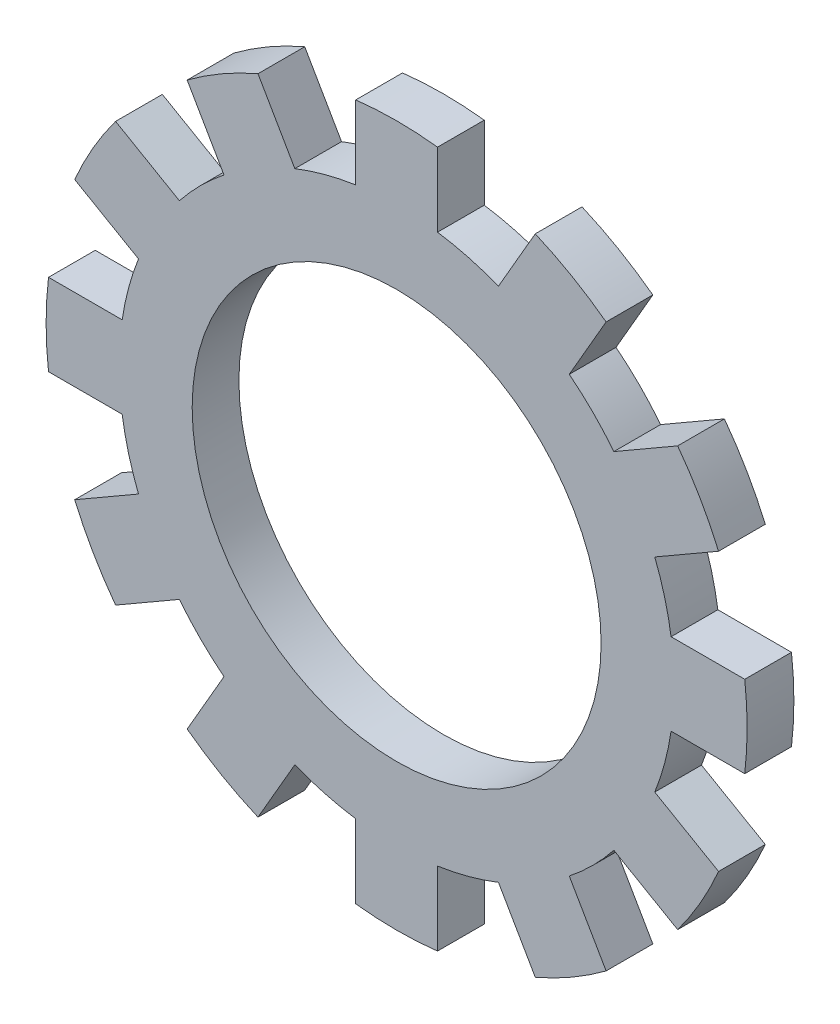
ISO-10303-21;
HEADER;
FILE_DESCRIPTION(('STEP AP214'),'2;1');
FILE_NAME('part.step','',(''),(''),'','','');
FILE_SCHEMA(('AUTOMOTIVE_DESIGN { 1 0 10303 214 1 1 1 1 }'));
ENDSEC;
DATA;
#1=APPLICATION_CONTEXT('core data for automotive mechanical design processes');
#2=APPLICATION_PROTOCOL_DEFINITION('international standard','automotive_design',2000,#1);
#3=PRODUCT_CONTEXT('',#1,'mechanical');
#4=PRODUCT('Part','Part','',(#3));
#5=PRODUCT_RELATED_PRODUCT_CATEGORY('part','',(#4));
#6=PRODUCT_DEFINITION_FORMATION('','',#4);
#7=PRODUCT_DEFINITION_CONTEXT('part definition',#1,'design');
#8=PRODUCT_DEFINITION('design','',#6,#7);
#9=PRODUCT_DEFINITION_SHAPE('','',#8);
#10=(LENGTH_UNIT() NAMED_UNIT(*) SI_UNIT(.MILLI.,.METRE.));
#11=(NAMED_UNIT(*) PLANE_ANGLE_UNIT() SI_UNIT($,.RADIAN.));
#12=(NAMED_UNIT(*) SI_UNIT($,.STERADIAN.) SOLID_ANGLE_UNIT());
#13=UNCERTAINTY_MEASURE_WITH_UNIT(LENGTH_MEASURE(1.E-05),#10,'distance_accuracy_value','');
#14=(GEOMETRIC_REPRESENTATION_CONTEXT(3) GLOBAL_UNCERTAINTY_ASSIGNED_CONTEXT((#13)) GLOBAL_UNIT_ASSIGNED_CONTEXT((#10,
#11,#12)) REPRESENTATION_CONTEXT('',''));
#15=CARTESIAN_POINT('',(0.,0.,0.));
#16=DIRECTION('',(0.,0.,1.));
#17=DIRECTION('',(1.,0.,0.));
#18=AXIS2_PLACEMENT_3D('',#15,#16,#17);
#19=CARTESIAN_POINT('',(0.,0.,0.2));
#20=DIRECTION('',(0.,0.,-1.));
#21=DIRECTION('',(-1.,0.,0.));
#22=AXIS2_PLACEMENT_3D('',#19,#20,#21);
#23=CYLINDRICAL_SURFACE('',#22,2.375);
#24=CARTESIAN_POINT('',(0.,0.,-0.2));
#25=DIRECTION('',(0.,0.,1.));
#26=DIRECTION('',(1.,0.,0.));
#27=AXIS2_PLACEMENT_3D('',#24,#25,#26);
#28=CIRCLE('',#27,2.375);
#29=CARTESIAN_POINT('',(1.85935339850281,1.47764337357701,-0.2));
#30=VERTEX_POINT('',#29);
#31=CARTESIAN_POINT('',(1.47764337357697,1.85935339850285,-0.2));
#32=VERTEX_POINT('',#31);
#33=EDGE_CURVE('E361',#30,#32,#28,.T.);
#34=ORIENTED_EDGE('',*,*,#33,.T.);
#35=DIRECTION('',(0.,0.,-1.));
#36=VECTOR('',#35,1.);
#37=CARTESIAN_POINT('',(1.47764337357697,1.85935339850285,0.2));
#38=LINE('',#37,#36);
#39=CARTESIAN_POINT('',(1.47764337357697,1.85935339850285,0.2));
#40=VERTEX_POINT('',#39);
#41=EDGE_CURVE('E352',#40,#32,#38,.T.);
#42=ORIENTED_EDGE('',*,*,#41,.F.);
#43=CARTESIAN_POINT('',(0.,0.,0.2));
#44=DIRECTION('',(0.,0.,1.));
#45=DIRECTION('',(1.,0.,0.));
#46=AXIS2_PLACEMENT_3D('',#43,#44,#45);
#47=CIRCLE('',#46,2.375);
#48=CARTESIAN_POINT('',(1.85935339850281,1.47764337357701,0.2));
#49=VERTEX_POINT('',#48);
#50=EDGE_CURVE('E64',#49,#40,#47,.T.);
#51=ORIENTED_EDGE('',*,*,#50,.F.);
#52=DIRECTION('',(0.,0.,-1.));
#53=VECTOR('',#52,1.);
#54=CARTESIAN_POINT('',(1.85935339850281,1.47764337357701,0.2));
#55=LINE('',#54,#53);
#56=EDGE_CURVE('E626',#49,#30,#55,.T.);
#57=ORIENTED_EDGE('',*,*,#56,.T.);
#58=EDGE_LOOP('',(#34,#42,#51,#57));
#59=FACE_BOUND('',#58,.T.);
#60=ADVANCED_FACE('F39',(#59),#23,.T.);
#61=DIRECTION('',(0.,0.,-1.));
#62=VECTOR('',#61,1.);
#63=CARTESIAN_POINT('',(0.871425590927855,2.20935339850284,0.2));
#64=LINE('',#63,#62);
#65=CARTESIAN_POINT('',(0.871425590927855,2.20935339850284,0.2));
#66=VERTEX_POINT('',#65);
#67=CARTESIAN_POINT('',(0.871425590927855,2.20935339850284,-0.2));
#68=VERTEX_POINT('',#67);
#69=EDGE_CURVE('E645',#66,#68,#64,.T.);
#70=ORIENTED_EDGE('',*,*,#69,.T.);
#71=CARTESIAN_POINT('',(0.35,2.34906896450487,-0.2));
#72=VERTEX_POINT('',#71);
#73=EDGE_CURVE('E388',#68,#72,#28,.T.);
#74=ORIENTED_EDGE('',*,*,#73,.T.);
#75=DIRECTION('',(0.,0.,-1.));
#76=VECTOR('',#75,1.);
#77=CARTESIAN_POINT('',(0.35,2.34906896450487,0.2));
#78=LINE('',#77,#76);
#79=CARTESIAN_POINT('',(0.35,2.34906896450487,0.2));
#80=VERTEX_POINT('',#79);
#81=EDGE_CURVE('E405',#80,#72,#78,.T.);
#82=ORIENTED_EDGE('',*,*,#81,.F.);
#83=EDGE_CURVE('E50',#66,#80,#47,.T.);
#84=ORIENTED_EDGE('',*,*,#83,.F.);
#85=EDGE_LOOP('',(#70,#74,#82,#84));
#86=FACE_BOUND('',#85,.T.);
#87=ADVANCED_FACE('F816',(#86),#23,.T.);
#88=CARTESIAN_POINT('',(2.34906896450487,0.350000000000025,-0.2));
#89=VERTEX_POINT('',#88);
#90=CARTESIAN_POINT('',(2.20935339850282,0.871425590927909,-0.2));
#91=VERTEX_POINT('',#90);
#92=EDGE_CURVE('E908',#89,#91,#28,.T.);
#93=ORIENTED_EDGE('',*,*,#92,.T.);
#94=DIRECTION('',(0.,0.,-1.));
#95=VECTOR('',#94,1.);
#96=CARTESIAN_POINT('',(2.20935339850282,0.871425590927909,0.2));
#97=LINE('',#96,#95);
#98=CARTESIAN_POINT('',(2.20935339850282,0.871425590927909,0.2));
#99=VERTEX_POINT('',#98);
#100=EDGE_CURVE('E785',#99,#91,#97,.T.);
#101=ORIENTED_EDGE('',*,*,#100,.F.);
#102=CARTESIAN_POINT('',(2.34906896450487,0.350000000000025,0.2));
#103=VERTEX_POINT('',#102);
#104=EDGE_CURVE('E371',#103,#99,#47,.T.);
#105=ORIENTED_EDGE('',*,*,#104,.F.);
#106=DIRECTION('',(0.,0.,-1.));
#107=VECTOR('',#106,1.);
#108=CARTESIAN_POINT('',(2.34906896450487,0.350000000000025,0.2));
#109=LINE('',#108,#107);
#110=EDGE_CURVE('E604',#103,#89,#109,.T.);
#111=ORIENTED_EDGE('',*,*,#110,.T.);
#112=EDGE_LOOP('',(#93,#101,#105,#111));
#113=FACE_BOUND('',#112,.T.);
#114=ADVANCED_FACE('F906',(#113),#23,.T.);
#115=CARTESIAN_POINT('',(2.20935339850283,-0.871425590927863,-0.2));
#116=VERTEX_POINT('',#115);
#117=CARTESIAN_POINT('',(2.34906896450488,-0.349999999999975,-0.2));
#118=VERTEX_POINT('',#117);
#119=EDGE_CURVE('E889',#116,#118,#28,.T.);
#120=ORIENTED_EDGE('',*,*,#119,.T.);
#121=DIRECTION('',(0.,0.,-1.));
#122=VECTOR('',#121,1.);
#123=CARTESIAN_POINT('',(2.34906896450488,-0.349999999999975,0.2));
#124=LINE('',#123,#122);
#125=CARTESIAN_POINT('',(2.34906896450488,-0.349999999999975,0.2));
#126=VERTEX_POINT('',#125);
#127=EDGE_CURVE('E771',#126,#118,#124,.T.);
#128=ORIENTED_EDGE('',*,*,#127,.F.);
#129=CARTESIAN_POINT('',(2.20935339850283,-0.871425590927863,0.2));
#130=VERTEX_POINT('',#129);
#131=EDGE_CURVE('E376',#130,#126,#47,.T.);
#132=ORIENTED_EDGE('',*,*,#131,.F.);
#133=DIRECTION('',(0.,0.,-1.));
#134=VECTOR('',#133,1.);
#135=CARTESIAN_POINT('',(2.20935339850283,-0.871425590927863,0.2));
#136=LINE('',#135,#134);
#137=EDGE_CURVE('E582',#130,#116,#136,.T.);
#138=ORIENTED_EDGE('',*,*,#137,.T.);
#139=EDGE_LOOP('',(#120,#128,#132,#138));
#140=FACE_BOUND('',#139,.T.);
#141=ADVANCED_FACE('F888',(#140),#23,.T.);
#142=CARTESIAN_POINT('',(1.47764337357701,-1.85935339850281,-0.2));
#143=VERTEX_POINT('',#142);
#144=CARTESIAN_POINT('',(1.85935339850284,-1.47764337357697,-0.2));
#145=VERTEX_POINT('',#144);
#146=EDGE_CURVE('E965',#143,#145,#28,.T.);
#147=ORIENTED_EDGE('',*,*,#146,.T.);
#148=DIRECTION('',(0.,0.,-1.));
#149=VECTOR('',#148,1.);
#150=CARTESIAN_POINT('',(1.85935339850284,-1.47764337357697,0.2));
#151=LINE('',#150,#149);
#152=CARTESIAN_POINT('',(1.85935339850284,-1.47764337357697,0.2));
#153=VERTEX_POINT('',#152);
#154=EDGE_CURVE('E757',#153,#145,#151,.T.);
#155=ORIENTED_EDGE('',*,*,#154,.F.);
#156=CARTESIAN_POINT('',(1.47764337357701,-1.85935339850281,0.2));
#157=VERTEX_POINT('',#156);
#158=EDGE_CURVE('E874',#157,#153,#47,.T.);
#159=ORIENTED_EDGE('',*,*,#158,.F.);
#160=DIRECTION('',(0.,0.,-1.));
#161=VECTOR('',#160,1.);
#162=CARTESIAN_POINT('',(1.47764337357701,-1.85935339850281,0.2));
#163=LINE('',#162,#161);
#164=EDGE_CURVE('E561',#157,#143,#163,.T.);
#165=ORIENTED_EDGE('',*,*,#164,.T.);
#166=EDGE_LOOP('',(#147,#155,#159,#165));
#167=FACE_BOUND('',#166,.T.);
#168=ADVANCED_FACE('F974',(#167),#23,.T.);
#169=CARTESIAN_POINT('',(0.35,-2.34906896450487,-0.2));
#170=VERTEX_POINT('',#169);
#171=CARTESIAN_POINT('',(0.871425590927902,-2.20935339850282,-0.2));
#172=VERTEX_POINT('',#171);
#173=EDGE_CURVE('E960',#170,#172,#28,.T.);
#174=ORIENTED_EDGE('',*,*,#173,.T.);
#175=DIRECTION('',(0.,0.,-1.));
#176=VECTOR('',#175,1.);
#177=CARTESIAN_POINT('',(0.871425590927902,-2.20935339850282,0.2));
#178=LINE('',#177,#176);
#179=CARTESIAN_POINT('',(0.871425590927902,-2.20935339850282,0.2));
#180=VERTEX_POINT('',#179);
#181=EDGE_CURVE('E743',#180,#172,#178,.T.);
#182=ORIENTED_EDGE('',*,*,#181,.F.);
#183=CARTESIAN_POINT('',(0.35,-2.34906896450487,0.2));
#184=VERTEX_POINT('',#183);
#185=EDGE_CURVE('E870',#184,#180,#47,.T.);
#186=ORIENTED_EDGE('',*,*,#185,.F.);
#187=DIRECTION('',(0.,0.,-1.));
#188=VECTOR('',#187,1.);
#189=CARTESIAN_POINT('',(0.35,-2.34906896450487,0.2));
#190=LINE('',#189,#188);
#191=EDGE_CURVE('E539',#184,#170,#190,.T.);
#192=ORIENTED_EDGE('',*,*,#191,.T.);
#193=EDGE_LOOP('',(#174,#182,#186,#192));
#194=FACE_BOUND('',#193,.T.);
#195=ADVANCED_FACE('F1402',(#194),#23,.T.);
#196=CARTESIAN_POINT('',(-0.87142559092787,-2.20935339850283,-0.2));
#197=VERTEX_POINT('',#196);
#198=CARTESIAN_POINT('',(-0.35,-2.34906896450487,-0.2));
#199=VERTEX_POINT('',#198);
#200=EDGE_CURVE('E956',#197,#199,#28,.T.);
#201=ORIENTED_EDGE('',*,*,#200,.T.);
#202=DIRECTION('',(0.,0.,-1.));
#203=VECTOR('',#202,1.);
#204=CARTESIAN_POINT('',(-0.35,-2.34906896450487,0.2));
#205=LINE('',#204,#203);
#206=CARTESIAN_POINT('',(-0.35,-2.34906896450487,0.2));
#207=VERTEX_POINT('',#206);
#208=EDGE_CURVE('E729',#207,#199,#205,.T.);
#209=ORIENTED_EDGE('',*,*,#208,.F.);
#210=CARTESIAN_POINT('',(-0.871425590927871,-2.20935339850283,0.2));
#211=VERTEX_POINT('',#210);
#212=EDGE_CURVE('E865',#211,#207,#47,.T.);
#213=ORIENTED_EDGE('',*,*,#212,.F.);
#214=DIRECTION('',(0.,0.,-1.));
#215=VECTOR('',#214,1.);
#216=CARTESIAN_POINT('',(-0.87142559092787,-2.20935339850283,0.2));
#217=LINE('',#216,#215);
#218=EDGE_CURVE('E517',#211,#197,#217,.T.);
#219=ORIENTED_EDGE('',*,*,#218,.T.);
#220=EDGE_LOOP('',(#201,#209,#213,#219));
#221=FACE_BOUND('',#220,.T.);
#222=ADVANCED_FACE('F1394',(#221),#23,.T.);
#223=CARTESIAN_POINT('',(-1.85935339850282,-1.477643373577,-0.2));
#224=VERTEX_POINT('',#223);
#225=CARTESIAN_POINT('',(-1.47764337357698,-1.85935339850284,-0.2));
#226=VERTEX_POINT('',#225);
#227=EDGE_CURVE('E952',#224,#226,#28,.T.);
#228=ORIENTED_EDGE('',*,*,#227,.T.);
#229=DIRECTION('',(0.,0.,-1.));
#230=VECTOR('',#229,1.);
#231=CARTESIAN_POINT('',(-1.47764337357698,-1.85935339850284,0.2));
#232=LINE('',#231,#230);
#233=CARTESIAN_POINT('',(-1.47764337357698,-1.85935339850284,0.2));
#234=VERTEX_POINT('',#233);
#235=EDGE_CURVE('E715',#234,#226,#232,.T.);
#236=ORIENTED_EDGE('',*,*,#235,.F.);
#237=CARTESIAN_POINT('',(-1.85935339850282,-1.477643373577,0.2));
#238=VERTEX_POINT('',#237);
#239=EDGE_CURVE('E861',#238,#234,#47,.T.);
#240=ORIENTED_EDGE('',*,*,#239,.F.);
#241=DIRECTION('',(0.,0.,-1.));
#242=VECTOR('',#241,1.);
#243=CARTESIAN_POINT('',(-1.85935339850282,-1.477643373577,0.2));
#244=LINE('',#243,#242);
#245=EDGE_CURVE('E495',#238,#224,#244,.T.);
#246=ORIENTED_EDGE('',*,*,#245,.T.);
#247=EDGE_LOOP('',(#228,#236,#240,#246));
#248=FACE_BOUND('',#247,.T.);
#249=ADVANCED_FACE('F1386',(#248),#23,.T.);
#250=CARTESIAN_POINT('',(-2.34906896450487,-0.350000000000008,-0.2));
#251=VERTEX_POINT('',#250);
#252=CARTESIAN_POINT('',(-2.20935339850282,-0.871425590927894,-0.2));
#253=VERTEX_POINT('',#252);
#254=EDGE_CURVE('E949',#251,#253,#28,.T.);
#255=ORIENTED_EDGE('',*,*,#254,.T.);
#256=DIRECTION('',(0.,0.,-1.));
#257=VECTOR('',#256,1.);
#258=CARTESIAN_POINT('',(-2.20935339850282,-0.871425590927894,0.2));
#259=LINE('',#258,#257);
#260=CARTESIAN_POINT('',(-2.20935339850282,-0.871425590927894,0.2));
#261=VERTEX_POINT('',#260);
#262=EDGE_CURVE('E701',#261,#253,#259,.T.);
#263=ORIENTED_EDGE('',*,*,#262,.F.);
#264=CARTESIAN_POINT('',(-2.34906896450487,-0.350000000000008,0.2));
#265=VERTEX_POINT('',#264);
#266=EDGE_CURVE('E856',#265,#261,#47,.T.);
#267=ORIENTED_EDGE('',*,*,#266,.F.);
#268=DIRECTION('',(0.,0.,-1.));
#269=VECTOR('',#268,1.);
#270=CARTESIAN_POINT('',(-2.34906896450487,-0.350000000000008,0.2));
#271=LINE('',#270,#269);
#272=EDGE_CURVE('E473',#265,#251,#271,.T.);
#273=ORIENTED_EDGE('',*,*,#272,.T.);
#274=EDGE_LOOP('',(#255,#263,#267,#273));
#275=FACE_BOUND('',#274,.T.);
#276=ADVANCED_FACE('F941',(#275),#23,.T.);
#277=CARTESIAN_POINT('',(-2.20935339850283,0.871425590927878,-0.2));
#278=VERTEX_POINT('',#277);
#279=CARTESIAN_POINT('',(-2.34906896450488,0.349999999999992,-0.2));
#280=VERTEX_POINT('',#279);
#281=EDGE_CURVE('E946',#278,#280,#28,.T.);
#282=ORIENTED_EDGE('',*,*,#281,.T.);
#283=DIRECTION('',(0.,0.,-1.));
#284=VECTOR('',#283,1.);
#285=CARTESIAN_POINT('',(-2.34906896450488,0.349999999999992,0.2));
#286=LINE('',#285,#284);
#287=CARTESIAN_POINT('',(-2.34906896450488,0.349999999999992,0.2));
#288=VERTEX_POINT('',#287);
#289=EDGE_CURVE('E687',#288,#280,#286,.T.);
#290=ORIENTED_EDGE('',*,*,#289,.F.);
#291=CARTESIAN_POINT('',(-2.20935339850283,0.871425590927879,0.2));
#292=VERTEX_POINT('',#291);
#293=EDGE_CURVE('E851',#292,#288,#47,.T.);
#294=ORIENTED_EDGE('',*,*,#293,.F.);
#295=DIRECTION('',(0.,0.,-1.));
#296=VECTOR('',#295,1.);
#297=CARTESIAN_POINT('',(-2.20935339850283,0.871425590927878,0.2));
#298=LINE('',#297,#296);
#299=EDGE_CURVE('E451',#292,#278,#298,.T.);
#300=ORIENTED_EDGE('',*,*,#299,.T.);
#301=EDGE_LOOP('',(#282,#290,#294,#300));
#302=FACE_BOUND('',#301,.T.);
#303=ADVANCED_FACE('F937',(#302),#23,.T.);
#304=CARTESIAN_POINT('',(-1.47764337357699,1.85935339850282,-0.2));
#305=VERTEX_POINT('',#304);
#306=CARTESIAN_POINT('',(-1.85935339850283,1.47764337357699,-0.2));
#307=VERTEX_POINT('',#306);
#308=EDGE_CURVE('E944',#305,#307,#28,.T.);
#309=ORIENTED_EDGE('',*,*,#308,.T.);
#310=DIRECTION('',(0.,0.,-1.));
#311=VECTOR('',#310,1.);
#312=CARTESIAN_POINT('',(-1.85935339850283,1.47764337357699,0.2));
#313=LINE('',#312,#311);
#314=CARTESIAN_POINT('',(-1.85935339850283,1.47764337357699,0.2));
#315=VERTEX_POINT('',#314);
#316=EDGE_CURVE('E673',#315,#307,#313,.T.);
#317=ORIENTED_EDGE('',*,*,#316,.F.);
#318=CARTESIAN_POINT('',(-1.47764337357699,1.85935339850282,0.2));
#319=VERTEX_POINT('',#318);
#320=EDGE_CURVE('E49',#319,#315,#47,.T.);
#321=ORIENTED_EDGE('',*,*,#320,.F.);
#322=DIRECTION('',(0.,0.,-1.));
#323=VECTOR('',#322,1.);
#324=CARTESIAN_POINT('',(-1.47764337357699,1.85935339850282,0.2));
#325=LINE('',#324,#323);
#326=EDGE_CURVE('E429',#319,#305,#325,.T.);
#327=ORIENTED_EDGE('',*,*,#326,.T.);
#328=EDGE_LOOP('',(#309,#317,#321,#327));
#329=FACE_BOUND('',#328,.T.);
#330=ADVANCED_FACE('F931',(#329),#23,.T.);
#331=CARTESIAN_POINT('',(-0.35,2.34906896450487,-0.2));
#332=VERTEX_POINT('',#331);
#333=CARTESIAN_POINT('',(-0.871425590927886,2.20935339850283,-0.2));
#334=VERTEX_POINT('',#333);
#335=EDGE_CURVE('E43',#332,#334,#28,.T.);
#336=ORIENTED_EDGE('',*,*,#335,.T.);
#337=DIRECTION('',(0.,0.,-1.));
#338=VECTOR('',#337,1.);
#339=CARTESIAN_POINT('',(-0.871425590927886,2.20935339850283,0.2));
#340=LINE('',#339,#338);
#341=CARTESIAN_POINT('',(-0.871425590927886,2.20935339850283,0.2));
#342=VERTEX_POINT('',#341);
#343=EDGE_CURVE('E657',#342,#334,#340,.T.);
#344=ORIENTED_EDGE('',*,*,#343,.F.);
#345=CARTESIAN_POINT('',(-0.35,2.34906896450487,0.2));
#346=VERTEX_POINT('',#345);
#347=EDGE_CURVE('E11',#346,#342,#47,.T.);
#348=ORIENTED_EDGE('',*,*,#347,.F.);
#349=DIRECTION('',(0.,0.,-1.));
#350=VECTOR('',#349,1.);
#351=CARTESIAN_POINT('',(-0.35,2.34906896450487,0.2));
#352=LINE('',#351,#350);
#353=EDGE_CURVE('E392',#346,#332,#352,.T.);
#354=ORIENTED_EDGE('',*,*,#353,.T.);
#355=EDGE_LOOP('',(#336,#344,#348,#354));
#356=FACE_BOUND('',#355,.T.);
#357=ADVANCED_FACE('F41',(#356),#23,.T.);
#358=CARTESIAN_POINT('',(0.,0.,0.2));
#359=DIRECTION('',(0.,0.,1.));
#360=DIRECTION('',(1.,0.,0.));
#361=AXIS2_PLACEMENT_3D('',#358,#359,#360);
#362=PLANE('',#361);
#363=ORIENTED_EDGE('',*,*,#347,.T.);
#364=DIRECTION('',(0.500000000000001,-0.866025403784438,0.));
#365=VECTOR('',#364,1.);
#366=CARTESIAN_POINT('',(-1.18664780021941,2.75533428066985,0.2));
#367=LINE('',#366,#365);
#368=CARTESIAN_POINT('',(-1.18664780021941,2.75533428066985,0.2));
#369=VERTEX_POINT('',#368);
#370=EDGE_CURVE('E668',#369,#342,#367,.T.);
#371=ORIENTED_EDGE('',*,*,#370,.F.);
#372=CARTESIAN_POINT('',(0.,0.,0.2));
#373=DIRECTION('',(0.,0.,1.));
#374=DIRECTION('',(0.866025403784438,0.500000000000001,0.));
#375=AXIS2_PLACEMENT_3D('',#372,#373,#374);
#376=CIRCLE('',#375,3.);
#377=CARTESIAN_POINT('',(-1.79286558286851,2.40533428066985,0.2));
#378=VERTEX_POINT('',#377);
#379=EDGE_CURVE('E438',#369,#378,#376,.T.);
#380=ORIENTED_EDGE('',*,*,#379,.T.);
#381=DIRECTION('',(0.500000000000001,-0.866025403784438,0.));
#382=VECTOR('',#381,1.);
#383=CARTESIAN_POINT('',(-1.79286558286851,2.40533428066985,0.2));
#384=LINE('',#383,#382);
#385=EDGE_CURVE('E433',#378,#319,#384,.T.);
#386=ORIENTED_EDGE('',*,*,#385,.T.);
#387=ORIENTED_EDGE('',*,*,#320,.T.);
#388=DIRECTION('',(0.86602540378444,-0.499999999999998,0.));
#389=VECTOR('',#388,1.);
#390=CARTESIAN_POINT('',(-2.40533428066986,1.79286558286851,0.2));
#391=LINE('',#390,#389);
#392=CARTESIAN_POINT('',(-2.40533428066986,1.79286558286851,0.2));
#393=VERTEX_POINT('',#392);
#394=EDGE_CURVE('E682',#393,#315,#391,.T.);
#395=ORIENTED_EDGE('',*,*,#394,.F.);
#396=CARTESIAN_POINT('',(0.,0.,0.2));
#397=DIRECTION('',(0.,0.,1.));
#398=DIRECTION('',(0.499999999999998,0.86602540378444,0.));
#399=AXIS2_PLACEMENT_3D('',#396,#397,#398);
#400=CIRCLE('',#399,3.);
#401=CARTESIAN_POINT('',(-2.75533428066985,1.1866478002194,0.2));
#402=VERTEX_POINT('',#401);
#403=EDGE_CURVE('E460',#393,#402,#400,.T.);
#404=ORIENTED_EDGE('',*,*,#403,.T.);
#405=DIRECTION('',(0.86602540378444,-0.499999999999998,0.));
#406=VECTOR('',#405,1.);
#407=CARTESIAN_POINT('',(-2.75533428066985,1.1866478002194,0.2));
#408=LINE('',#407,#406);
#409=EDGE_CURVE('E455',#402,#292,#408,.T.);
#410=ORIENTED_EDGE('',*,*,#409,.T.);
#411=ORIENTED_EDGE('',*,*,#293,.T.);
#412=DIRECTION('',(1.,0.,0.));
#413=VECTOR('',#412,1.);
#414=CARTESIAN_POINT('',(-2.97951338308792,0.34999999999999,0.2));
#415=LINE('',#414,#413);
#416=CARTESIAN_POINT('',(-2.97951338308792,0.349999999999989,0.2));
#417=VERTEX_POINT('',#416);
#418=EDGE_CURVE('E696',#417,#288,#415,.T.);
#419=ORIENTED_EDGE('',*,*,#418,.F.);
#420=CARTESIAN_POINT('',(0.,0.,0.2));
#421=DIRECTION('',(0.,0.,1.));
#422=DIRECTION('',(0.,1.,0.));
#423=AXIS2_PLACEMENT_3D('',#420,#421,#422);
#424=CIRCLE('',#423,3.);
#425=CARTESIAN_POINT('',(-2.97951338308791,-0.35000000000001,0.2));
#426=VERTEX_POINT('',#425);
#427=EDGE_CURVE('E482',#417,#426,#424,.T.);
#428=ORIENTED_EDGE('',*,*,#427,.T.);
#429=DIRECTION('',(1.,0.,0.));
#430=VECTOR('',#429,1.);
#431=CARTESIAN_POINT('',(-2.97951338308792,-0.35000000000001,0.2));
#432=LINE('',#431,#430);
#433=EDGE_CURVE('E477',#426,#265,#432,.T.);
#434=ORIENTED_EDGE('',*,*,#433,.T.);
#435=ORIENTED_EDGE('',*,*,#266,.T.);
#436=DIRECTION('',(0.866025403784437,0.500000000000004,0.));
#437=VECTOR('',#436,1.);
#438=CARTESIAN_POINT('',(-2.75533428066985,-1.18664780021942,0.2));
#439=LINE('',#438,#437);
#440=CARTESIAN_POINT('',(-2.75533428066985,-1.18664780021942,0.2));
#441=VERTEX_POINT('',#440);
#442=EDGE_CURVE('E710',#441,#261,#439,.T.);
#443=ORIENTED_EDGE('',*,*,#442,.F.);
#444=CARTESIAN_POINT('',(0.,0.,0.2));
#445=DIRECTION('',(0.,0.,1.));
#446=DIRECTION('',(-0.500000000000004,0.866025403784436,0.));
#447=AXIS2_PLACEMENT_3D('',#444,#445,#446);
#448=CIRCLE('',#447,3.);
#449=CARTESIAN_POINT('',(-2.40533428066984,-1.79286558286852,0.2));
#450=VERTEX_POINT('',#449);
#451=EDGE_CURVE('E504',#441,#450,#448,.T.);
#452=ORIENTED_EDGE('',*,*,#451,.T.);
#453=DIRECTION('',(0.866025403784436,0.500000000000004,0.));
#454=VECTOR('',#453,1.);
#455=CARTESIAN_POINT('',(-2.40533428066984,-1.79286558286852,0.2));
#456=LINE('',#455,#454);
#457=EDGE_CURVE('E499',#450,#238,#456,.T.);
#458=ORIENTED_EDGE('',*,*,#457,.T.);
#459=ORIENTED_EDGE('',*,*,#239,.T.);
#460=DIRECTION('',(0.499999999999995,0.866025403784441,0.));
#461=VECTOR('',#460,1.);
#462=CARTESIAN_POINT('',(-1.7928655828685,-2.40533428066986,0.2));
#463=LINE('',#462,#461);
#464=CARTESIAN_POINT('',(-1.7928655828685,-2.40533428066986,0.2));
#465=VERTEX_POINT('',#464);
#466=EDGE_CURVE('E724',#465,#234,#463,.T.);
#467=ORIENTED_EDGE('',*,*,#466,.F.);
#468=CARTESIAN_POINT('',(0.,0.,0.2));
#469=DIRECTION('',(0.,0.,1.));
#470=DIRECTION('',(-0.866025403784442,0.499999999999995,0.));
#471=AXIS2_PLACEMENT_3D('',#468,#469,#470);
#472=CIRCLE('',#471,3.);
#473=CARTESIAN_POINT('',(-1.18664780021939,-2.75533428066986,0.2));
#474=VERTEX_POINT('',#473);
#475=EDGE_CURVE('E526',#465,#474,#472,.T.);
#476=ORIENTED_EDGE('',*,*,#475,.T.);
#477=DIRECTION('',(0.499999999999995,0.866025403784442,0.));
#478=VECTOR('',#477,1.);
#479=CARTESIAN_POINT('',(-1.18664780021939,-2.75533428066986,0.2));
#480=LINE('',#479,#478);
#481=EDGE_CURVE('E521',#474,#211,#480,.T.);
#482=ORIENTED_EDGE('',*,*,#481,.T.);
#483=ORIENTED_EDGE('',*,*,#212,.T.);
#484=DIRECTION('',(0.,1.,0.));
#485=VECTOR('',#484,1.);
#486=CARTESIAN_POINT('',(-0.35,-2.97951338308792,0.2));
#487=LINE('',#486,#485);
#488=CARTESIAN_POINT('',(-0.35,-2.97951338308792,0.2));
#489=VERTEX_POINT('',#488);
#490=EDGE_CURVE('E738',#489,#207,#487,.T.);
#491=ORIENTED_EDGE('',*,*,#490,.F.);
#492=CARTESIAN_POINT('',(0.,0.,0.2));
#493=DIRECTION('',(0.,0.,1.));
#494=DIRECTION('',(-1.,0.,0.));
#495=AXIS2_PLACEMENT_3D('',#492,#493,#494);
#496=CIRCLE('',#495,3.);
#497=CARTESIAN_POINT('',(0.35,-2.97951338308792,0.2));
#498=VERTEX_POINT('',#497);
#499=EDGE_CURVE('E548',#489,#498,#496,.T.);
#500=ORIENTED_EDGE('',*,*,#499,.T.);
#501=DIRECTION('',(0.,1.,0.));
#502=VECTOR('',#501,1.);
#503=CARTESIAN_POINT('',(0.35,-2.97951338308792,0.2));
#504=LINE('',#503,#502);
#505=EDGE_CURVE('E543',#498,#184,#504,.T.);
#506=ORIENTED_EDGE('',*,*,#505,.T.);
#507=ORIENTED_EDGE('',*,*,#185,.T.);
#508=DIRECTION('',(-0.500000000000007,0.866025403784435,0.));
#509=VECTOR('',#508,1.);
#510=CARTESIAN_POINT('',(1.18664780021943,-2.75533428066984,0.2));
#511=LINE('',#510,#509);
#512=CARTESIAN_POINT('',(1.18664780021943,-2.75533428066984,0.2));
#513=VERTEX_POINT('',#512);
#514=EDGE_CURVE('E752',#513,#180,#511,.T.);
#515=ORIENTED_EDGE('',*,*,#514,.F.);
#516=CARTESIAN_POINT('',(0.,0.,0.2));
#517=DIRECTION('',(0.,0.,1.));
#518=DIRECTION('',(-0.866025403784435,-0.500000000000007,0.));
#519=AXIS2_PLACEMENT_3D('',#516,#517,#518);
#520=CIRCLE('',#519,3.);
#521=CARTESIAN_POINT('',(1.79286558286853,-2.40533428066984,0.2));
#522=VERTEX_POINT('',#521);
#523=EDGE_CURVE('E570',#513,#522,#520,.T.);
#524=ORIENTED_EDGE('',*,*,#523,.T.);
#525=DIRECTION('',(-0.500000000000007,0.866025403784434,0.));
#526=VECTOR('',#525,1.);
#527=CARTESIAN_POINT('',(1.79286558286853,-2.40533428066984,0.2));
#528=LINE('',#527,#526);
#529=EDGE_CURVE('E565',#522,#157,#528,.T.);
#530=ORIENTED_EDGE('',*,*,#529,.T.);
#531=ORIENTED_EDGE('',*,*,#158,.T.);
#532=DIRECTION('',(-0.866025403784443,0.499999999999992,0.));
#533=VECTOR('',#532,1.);
#534=CARTESIAN_POINT('',(2.40533428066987,-1.79286558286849,0.2));
#535=LINE('',#534,#533);
#536=CARTESIAN_POINT('',(2.40533428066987,-1.79286558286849,0.2));
#537=VERTEX_POINT('',#536);
#538=EDGE_CURVE('E766',#537,#153,#535,.T.);
#539=ORIENTED_EDGE('',*,*,#538,.F.);
#540=CARTESIAN_POINT('',(0.,0.,0.2));
#541=DIRECTION('',(0.,0.,1.));
#542=DIRECTION('',(-0.499999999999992,-0.866025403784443,0.));
#543=AXIS2_PLACEMENT_3D('',#540,#541,#542);
#544=CIRCLE('',#543,3.);
#545=CARTESIAN_POINT('',(2.75533428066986,-1.18664780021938,0.2));
#546=VERTEX_POINT('',#545);
#547=EDGE_CURVE('E591',#537,#546,#544,.T.);
#548=ORIENTED_EDGE('',*,*,#547,.T.);
#549=DIRECTION('',(-0.866025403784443,0.499999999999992,0.));
#550=VECTOR('',#549,1.);
#551=CARTESIAN_POINT('',(2.75533428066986,-1.18664780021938,0.2));
#552=LINE('',#551,#550);
#553=EDGE_CURVE('E586',#546,#130,#552,.T.);
#554=ORIENTED_EDGE('',*,*,#553,.T.);
#555=ORIENTED_EDGE('',*,*,#131,.T.);
#556=DIRECTION('',(-1.,0.,0.));
#557=VECTOR('',#556,1.);
#558=CARTESIAN_POINT('',(2.97951338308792,-0.349999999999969,0.2));
#559=LINE('',#558,#557);
#560=CARTESIAN_POINT('',(2.97951338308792,-0.349999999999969,0.2));
#561=VERTEX_POINT('',#560);
#562=EDGE_CURVE('E780',#561,#126,#559,.T.);
#563=ORIENTED_EDGE('',*,*,#562,.F.);
#564=CARTESIAN_POINT('',(0.,0.,0.2));
#565=DIRECTION('',(0.,0.,1.));
#566=DIRECTION('',(0.,-1.,0.));
#567=AXIS2_PLACEMENT_3D('',#564,#565,#566);
#568=CIRCLE('',#567,3.);
#569=CARTESIAN_POINT('',(2.97951338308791,0.350000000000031,0.2));
#570=VERTEX_POINT('',#569);
#571=EDGE_CURVE('E613',#561,#570,#568,.T.);
#572=ORIENTED_EDGE('',*,*,#571,.T.);
#573=DIRECTION('',(-1.,0.,0.));
#574=VECTOR('',#573,1.);
#575=CARTESIAN_POINT('',(2.97951338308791,0.350000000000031,0.2));
#576=LINE('',#575,#574);
#577=EDGE_CURVE('E608',#570,#103,#576,.T.);
#578=ORIENTED_EDGE('',*,*,#577,.T.);
#579=ORIENTED_EDGE('',*,*,#104,.T.);
#580=DIRECTION('',(-0.866025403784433,-0.50000000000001,0.));
#581=VECTOR('',#580,1.);
#582=CARTESIAN_POINT('',(2.75533428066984,1.18664780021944,0.2));
#583=LINE('',#582,#581);
#584=CARTESIAN_POINT('',(2.75533428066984,1.18664780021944,0.2));
#585=VERTEX_POINT('',#584);
#586=EDGE_CURVE('E794',#585,#99,#583,.T.);
#587=ORIENTED_EDGE('',*,*,#586,.F.);
#588=CARTESIAN_POINT('',(0.,0.,0.2));
#589=DIRECTION('',(0.,0.,1.));
#590=DIRECTION('',(0.50000000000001,-0.866025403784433,0.));
#591=AXIS2_PLACEMENT_3D('',#588,#589,#590);
#592=CIRCLE('',#591,3.);
#593=CARTESIAN_POINT('',(2.40533428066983,1.79286558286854,0.2));
#594=VERTEX_POINT('',#593);
#595=EDGE_CURVE('E633',#585,#594,#592,.T.);
#596=ORIENTED_EDGE('',*,*,#595,.T.);
#597=DIRECTION('',(-0.866025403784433,-0.50000000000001,0.));
#598=VECTOR('',#597,1.);
#599=CARTESIAN_POINT('',(2.40533428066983,1.79286558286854,0.2));
#600=LINE('',#599,#598);
#601=EDGE_CURVE('E368',#594,#49,#600,.T.);
#602=ORIENTED_EDGE('',*,*,#601,.T.);
#603=ORIENTED_EDGE('',*,*,#50,.T.);
#604=DIRECTION('',(-0.499999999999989,-0.866025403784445,0.));
#605=VECTOR('',#604,1.);
#606=CARTESIAN_POINT('',(1.79286558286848,2.40533428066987,0.2));
#607=LINE('',#606,#605);
#608=CARTESIAN_POINT('',(1.79286558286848,2.40533428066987,0.2));
#609=VERTEX_POINT('',#608);
#610=EDGE_CURVE('E349',#609,#40,#607,.T.);
#611=ORIENTED_EDGE('',*,*,#610,.F.);
#612=CARTESIAN_POINT('',(0.,0.,0.2));
#613=DIRECTION('',(0.,0.,1.));
#614=DIRECTION('',(0.866025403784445,-0.499999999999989,0.));
#615=AXIS2_PLACEMENT_3D('',#612,#613,#614);
#616=CIRCLE('',#615,3.);
#617=CARTESIAN_POINT('',(1.18664780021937,2.75533428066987,0.2));
#618=VERTEX_POINT('',#617);
#619=EDGE_CURVE('E653',#609,#618,#616,.T.);
#620=ORIENTED_EDGE('',*,*,#619,.T.);
#621=DIRECTION('',(-0.499999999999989,-0.866025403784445,0.));
#622=VECTOR('',#621,1.);
#623=CARTESIAN_POINT('',(1.18664780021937,2.75533428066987,0.2));
#624=LINE('',#623,#622);
#625=EDGE_CURVE('E648',#618,#66,#624,.T.);
#626=ORIENTED_EDGE('',*,*,#625,.T.);
#627=ORIENTED_EDGE('',*,*,#83,.T.);
#628=DIRECTION('',(0.,-1.,0.));
#629=VECTOR('',#628,1.);
#630=CARTESIAN_POINT('',(0.35,2.97951338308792,0.2));
#631=LINE('',#630,#629);
#632=CARTESIAN_POINT('',(0.35,2.97951338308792,0.2));
#633=VERTEX_POINT('',#632);
#634=EDGE_CURVE('E417',#633,#80,#631,.T.);
#635=ORIENTED_EDGE('',*,*,#634,.F.);
#636=CARTESIAN_POINT('',(0.,0.,0.2));
#637=DIRECTION('',(0.,0.,1.));
#638=DIRECTION('',(1.,0.,0.));
#639=AXIS2_PLACEMENT_3D('',#636,#637,#638);
#640=CIRCLE('',#639,3.);
#641=CARTESIAN_POINT('',(-0.35,2.97951338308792,0.2));
#642=VERTEX_POINT('',#641);
#643=EDGE_CURVE('E401',#633,#642,#640,.T.);
#644=ORIENTED_EDGE('',*,*,#643,.T.);
#645=DIRECTION('',(0.,-1.,0.));
#646=VECTOR('',#645,1.);
#647=CARTESIAN_POINT('',(-0.35,2.97951338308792,0.2));
#648=LINE('',#647,#646);
#649=EDGE_CURVE('E396',#642,#346,#648,.T.);
#650=ORIENTED_EDGE('',*,*,#649,.T.);
#651=EDGE_LOOP('',(#363,#371,#380,#386,#387,#395,#404,#410,#411,#419,#428,#434,#435,#443,#452,
#458,#459,#467,#476,#482,#483,#491,#500,#506,#507,#515,#524,#530,#531,#539,#548,#554,#555,#563,
#572,#578,#579,#587,#596,#602,#603,#611,#620,#626,#627,#635,#644,#650));
#652=FACE_BOUND('',#651,.T.);
#653=CARTESIAN_POINT('',(0.,0.,0.2));
#654=DIRECTION('',(0.,0.,1.));
#655=DIRECTION('',(1.,0.,0.));
#656=AXIS2_PLACEMENT_3D('',#653,#654,#655);
#657=CIRCLE('',#656,1.75);
#658=CARTESIAN_POINT('',(1.75,0.,0.2));
#659=VERTEX_POINT('',#658);
#660=EDGE_CURVE('E383',#659,#659,#657,.T.);
#661=ORIENTED_EDGE('',*,*,#660,.F.);
#662=EDGE_LOOP('',(#661));
#663=FACE_BOUND('',#662,.T.);
#664=ADVANCED_FACE('F365',(#652,#663),#362,.T.);
#665=CARTESIAN_POINT('',(0.,0.,-0.2));
#666=DIRECTION('',(0.,0.,1.));
#667=DIRECTION('',(1.,0.,0.));
#668=AXIS2_PLACEMENT_3D('',#665,#666,#667);
#669=PLANE('',#668);
#670=ORIENTED_EDGE('',*,*,#335,.F.);
#671=DIRECTION('',(0.,-1.,0.));
#672=VECTOR('',#671,1.);
#673=CARTESIAN_POINT('',(-0.35,2.97951338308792,-0.2));
#674=LINE('',#673,#672);
#675=CARTESIAN_POINT('',(-0.35,2.97951338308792,-0.2));
#676=VERTEX_POINT('',#675);
#677=EDGE_CURVE('E397',#676,#332,#674,.T.);
#678=ORIENTED_EDGE('',*,*,#677,.F.);
#679=CARTESIAN_POINT('',(0.,0.,-0.2));
#680=DIRECTION('',(0.,0.,1.));
#681=DIRECTION('',(1.,0.,0.));
#682=AXIS2_PLACEMENT_3D('',#679,#680,#681);
#683=CIRCLE('',#682,3.);
#684=CARTESIAN_POINT('',(0.35,2.97951338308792,-0.2));
#685=VERTEX_POINT('',#684);
#686=EDGE_CURVE('E402',#685,#676,#683,.T.);
#687=ORIENTED_EDGE('',*,*,#686,.F.);
#688=DIRECTION('',(0.,-1.,0.));
#689=VECTOR('',#688,1.);
#690=CARTESIAN_POINT('',(0.35,2.97951338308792,-0.2));
#691=LINE('',#690,#689);
#692=EDGE_CURVE('E418',#685,#72,#691,.T.);
#693=ORIENTED_EDGE('',*,*,#692,.T.);
#694=ORIENTED_EDGE('',*,*,#73,.F.);
#695=DIRECTION('',(-0.499999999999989,-0.866025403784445,0.));
#696=VECTOR('',#695,1.);
#697=CARTESIAN_POINT('',(1.18664780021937,2.75533428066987,-0.2));
#698=LINE('',#697,#696);
#699=CARTESIAN_POINT('',(1.18664780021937,2.75533428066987,-0.2));
#700=VERTEX_POINT('',#699);
#701=EDGE_CURVE('E649',#700,#68,#698,.T.);
#702=ORIENTED_EDGE('',*,*,#701,.F.);
#703=CARTESIAN_POINT('',(0.,0.,-0.2));
#704=DIRECTION('',(0.,0.,1.));
#705=DIRECTION('',(0.866025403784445,-0.499999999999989,0.));
#706=AXIS2_PLACEMENT_3D('',#703,#704,#705);
#707=CIRCLE('',#706,3.);
#708=CARTESIAN_POINT('',(1.79286558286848,2.40533428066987,-0.2));
#709=VERTEX_POINT('',#708);
#710=EDGE_CURVE('E654',#709,#700,#707,.T.);
#711=ORIENTED_EDGE('',*,*,#710,.F.);
#712=DIRECTION('',(-0.499999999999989,-0.866025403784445,0.));
#713=VECTOR('',#712,1.);
#714=CARTESIAN_POINT('',(1.79286558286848,2.40533428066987,-0.2));
#715=LINE('',#714,#713);
#716=EDGE_CURVE('E358',#709,#32,#715,.T.);
#717=ORIENTED_EDGE('',*,*,#716,.T.);
#718=ORIENTED_EDGE('',*,*,#33,.F.);
#719=DIRECTION('',(-0.866025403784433,-0.50000000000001,0.));
#720=VECTOR('',#719,1.);
#721=CARTESIAN_POINT('',(2.40533428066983,1.79286558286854,-0.2));
#722=LINE('',#721,#720);
#723=CARTESIAN_POINT('',(2.40533428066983,1.79286558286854,-0.2));
#724=VERTEX_POINT('',#723);
#725=EDGE_CURVE('E629',#724,#30,#722,.T.);
#726=ORIENTED_EDGE('',*,*,#725,.F.);
#727=CARTESIAN_POINT('',(0.,0.,-0.2));
#728=DIRECTION('',(0.,0.,1.));
#729=DIRECTION('',(0.50000000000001,-0.866025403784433,0.));
#730=AXIS2_PLACEMENT_3D('',#727,#728,#729);
#731=CIRCLE('',#730,3.);
#732=CARTESIAN_POINT('',(2.75533428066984,1.18664780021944,-0.2));
#733=VERTEX_POINT('',#732);
#734=EDGE_CURVE('E634',#733,#724,#731,.T.);
#735=ORIENTED_EDGE('',*,*,#734,.F.);
#736=DIRECTION('',(-0.866025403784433,-0.50000000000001,0.));
#737=VECTOR('',#736,1.);
#738=CARTESIAN_POINT('',(2.75533428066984,1.18664780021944,-0.2));
#739=LINE('',#738,#737);
#740=EDGE_CURVE('E363',#733,#91,#739,.T.);
#741=ORIENTED_EDGE('',*,*,#740,.T.);
#742=ORIENTED_EDGE('',*,*,#92,.F.);
#743=DIRECTION('',(-1.,0.,0.));
#744=VECTOR('',#743,1.);
#745=CARTESIAN_POINT('',(2.97951338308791,0.350000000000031,-0.2));
#746=LINE('',#745,#744);
#747=CARTESIAN_POINT('',(2.97951338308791,0.350000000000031,-0.2));
#748=VERTEX_POINT('',#747);
#749=EDGE_CURVE('E609',#748,#89,#746,.T.);
#750=ORIENTED_EDGE('',*,*,#749,.F.);
#751=CARTESIAN_POINT('',(0.,0.,-0.2));
#752=DIRECTION('',(0.,0.,1.));
#753=DIRECTION('',(0.,-1.,0.));
#754=AXIS2_PLACEMENT_3D('',#751,#752,#753);
#755=CIRCLE('',#754,3.);
#756=CARTESIAN_POINT('',(2.97951338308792,-0.349999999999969,-0.2));
#757=VERTEX_POINT('',#756);
#758=EDGE_CURVE('E614',#757,#748,#755,.T.);
#759=ORIENTED_EDGE('',*,*,#758,.F.);
#760=DIRECTION('',(-1.,0.,0.));
#761=VECTOR('',#760,1.);
#762=CARTESIAN_POINT('',(2.97951338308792,-0.349999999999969,-0.2));
#763=LINE('',#762,#761);
#764=EDGE_CURVE('E781',#757,#118,#763,.T.);
#765=ORIENTED_EDGE('',*,*,#764,.T.);
#766=ORIENTED_EDGE('',*,*,#119,.F.);
#767=DIRECTION('',(-0.866025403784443,0.499999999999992,0.));
#768=VECTOR('',#767,1.);
#769=CARTESIAN_POINT('',(2.75533428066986,-1.18664780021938,-0.2));
#770=LINE('',#769,#768);
#771=CARTESIAN_POINT('',(2.75533428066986,-1.18664780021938,-0.2));
#772=VERTEX_POINT('',#771);
#773=EDGE_CURVE('E587',#772,#116,#770,.T.);
#774=ORIENTED_EDGE('',*,*,#773,.F.);
#775=CARTESIAN_POINT('',(0.,0.,-0.2));
#776=DIRECTION('',(0.,0.,1.));
#777=DIRECTION('',(-0.499999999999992,-0.866025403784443,0.));
#778=AXIS2_PLACEMENT_3D('',#775,#776,#777);
#779=CIRCLE('',#778,3.);
#780=CARTESIAN_POINT('',(2.40533428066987,-1.79286558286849,-0.2));
#781=VERTEX_POINT('',#780);
#782=EDGE_CURVE('E592',#781,#772,#779,.T.);
#783=ORIENTED_EDGE('',*,*,#782,.F.);
#784=DIRECTION('',(-0.866025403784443,0.499999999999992,0.));
#785=VECTOR('',#784,1.);
#786=CARTESIAN_POINT('',(2.40533428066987,-1.79286558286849,-0.2));
#787=LINE('',#786,#785);
#788=EDGE_CURVE('E767',#781,#145,#787,.T.);
#789=ORIENTED_EDGE('',*,*,#788,.T.);
#790=ORIENTED_EDGE('',*,*,#146,.F.);
#791=DIRECTION('',(-0.500000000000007,0.866025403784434,0.));
#792=VECTOR('',#791,1.);
#793=CARTESIAN_POINT('',(1.79286558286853,-2.40533428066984,-0.2));
#794=LINE('',#793,#792);
#795=CARTESIAN_POINT('',(1.79286558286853,-2.40533428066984,-0.2));
#796=VERTEX_POINT('',#795);
#797=EDGE_CURVE('E566',#796,#143,#794,.T.);
#798=ORIENTED_EDGE('',*,*,#797,.F.);
#799=CARTESIAN_POINT('',(0.,0.,-0.2));
#800=DIRECTION('',(0.,0.,1.));
#801=DIRECTION('',(-0.866025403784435,-0.500000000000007,0.));
#802=AXIS2_PLACEMENT_3D('',#799,#800,#801);
#803=CIRCLE('',#802,3.);
#804=CARTESIAN_POINT('',(1.18664780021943,-2.75533428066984,-0.2));
#805=VERTEX_POINT('',#804);
#806=EDGE_CURVE('E571',#805,#796,#803,.T.);
#807=ORIENTED_EDGE('',*,*,#806,.F.);
#808=DIRECTION('',(-0.500000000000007,0.866025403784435,0.));
#809=VECTOR('',#808,1.);
#810=CARTESIAN_POINT('',(1.18664780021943,-2.75533428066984,-0.2));
#811=LINE('',#810,#809);
#812=EDGE_CURVE('E753',#805,#172,#811,.T.);
#813=ORIENTED_EDGE('',*,*,#812,.T.);
#814=ORIENTED_EDGE('',*,*,#173,.F.);
#815=DIRECTION('',(0.,1.,0.));
#816=VECTOR('',#815,1.);
#817=CARTESIAN_POINT('',(0.35,-2.97951338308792,-0.2));
#818=LINE('',#817,#816);
#819=CARTESIAN_POINT('',(0.35,-2.97951338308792,-0.2));
#820=VERTEX_POINT('',#819);
#821=EDGE_CURVE('E544',#820,#170,#818,.T.);
#822=ORIENTED_EDGE('',*,*,#821,.F.);
#823=CARTESIAN_POINT('',(0.,0.,-0.2));
#824=DIRECTION('',(0.,0.,1.));
#825=DIRECTION('',(-1.,0.,0.));
#826=AXIS2_PLACEMENT_3D('',#823,#824,#825);
#827=CIRCLE('',#826,3.);
#828=CARTESIAN_POINT('',(-0.35,-2.97951338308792,-0.2));
#829=VERTEX_POINT('',#828);
#830=EDGE_CURVE('E549',#829,#820,#827,.T.);
#831=ORIENTED_EDGE('',*,*,#830,.F.);
#832=DIRECTION('',(0.,1.,0.));
#833=VECTOR('',#832,1.);
#834=CARTESIAN_POINT('',(-0.35,-2.97951338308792,-0.2));
#835=LINE('',#834,#833);
#836=EDGE_CURVE('E739',#829,#199,#835,.T.);
#837=ORIENTED_EDGE('',*,*,#836,.T.);
#838=ORIENTED_EDGE('',*,*,#200,.F.);
#839=DIRECTION('',(0.499999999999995,0.866025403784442,0.));
#840=VECTOR('',#839,1.);
#841=CARTESIAN_POINT('',(-1.18664780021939,-2.75533428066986,-0.2));
#842=LINE('',#841,#840);
#843=CARTESIAN_POINT('',(-1.18664780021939,-2.75533428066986,-0.2));
#844=VERTEX_POINT('',#843);
#845=EDGE_CURVE('E522',#844,#197,#842,.T.);
#846=ORIENTED_EDGE('',*,*,#845,.F.);
#847=CARTESIAN_POINT('',(0.,0.,-0.2));
#848=DIRECTION('',(0.,0.,1.));
#849=DIRECTION('',(-0.866025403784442,0.499999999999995,0.));
#850=AXIS2_PLACEMENT_3D('',#847,#848,#849);
#851=CIRCLE('',#850,3.);
#852=CARTESIAN_POINT('',(-1.7928655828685,-2.40533428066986,-0.2));
#853=VERTEX_POINT('',#852);
#854=EDGE_CURVE('E527',#853,#844,#851,.T.);
#855=ORIENTED_EDGE('',*,*,#854,.F.);
#856=DIRECTION('',(0.499999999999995,0.866025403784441,0.));
#857=VECTOR('',#856,1.);
#858=CARTESIAN_POINT('',(-1.7928655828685,-2.40533428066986,-0.2));
#859=LINE('',#858,#857);
#860=EDGE_CURVE('E725',#853,#226,#859,.T.);
#861=ORIENTED_EDGE('',*,*,#860,.T.);
#862=ORIENTED_EDGE('',*,*,#227,.F.);
#863=DIRECTION('',(0.866025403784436,0.500000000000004,0.));
#864=VECTOR('',#863,1.);
#865=CARTESIAN_POINT('',(-2.40533428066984,-1.79286558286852,-0.2));
#866=LINE('',#865,#864);
#867=CARTESIAN_POINT('',(-2.40533428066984,-1.79286558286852,-0.2));
#868=VERTEX_POINT('',#867);
#869=EDGE_CURVE('E500',#868,#224,#866,.T.);
#870=ORIENTED_EDGE('',*,*,#869,.F.);
#871=CARTESIAN_POINT('',(0.,0.,-0.2));
#872=DIRECTION('',(0.,0.,1.));
#873=DIRECTION('',(-0.500000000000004,0.866025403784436,0.));
#874=AXIS2_PLACEMENT_3D('',#871,#872,#873);
#875=CIRCLE('',#874,3.);
#876=CARTESIAN_POINT('',(-2.75533428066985,-1.18664780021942,-0.2));
#877=VERTEX_POINT('',#876);
#878=EDGE_CURVE('E505',#877,#868,#875,.T.);
#879=ORIENTED_EDGE('',*,*,#878,.F.);
#880=DIRECTION('',(0.866025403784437,0.500000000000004,0.));
#881=VECTOR('',#880,1.);
#882=CARTESIAN_POINT('',(-2.75533428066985,-1.18664780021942,-0.2));
#883=LINE('',#882,#881);
#884=EDGE_CURVE('E711',#877,#253,#883,.T.);
#885=ORIENTED_EDGE('',*,*,#884,.T.);
#886=ORIENTED_EDGE('',*,*,#254,.F.);
#887=DIRECTION('',(1.,0.,0.));
#888=VECTOR('',#887,1.);
#889=CARTESIAN_POINT('',(-2.97951338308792,-0.35000000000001,-0.2));
#890=LINE('',#889,#888);
#891=CARTESIAN_POINT('',(-2.97951338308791,-0.35000000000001,-0.2));
#892=VERTEX_POINT('',#891);
#893=EDGE_CURVE('E478',#892,#251,#890,.T.);
#894=ORIENTED_EDGE('',*,*,#893,.F.);
#895=CARTESIAN_POINT('',(0.,0.,-0.2));
#896=DIRECTION('',(0.,0.,1.));
#897=DIRECTION('',(0.,1.,0.));
#898=AXIS2_PLACEMENT_3D('',#895,#896,#897);
#899=CIRCLE('',#898,3.);
#900=CARTESIAN_POINT('',(-2.97951338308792,0.349999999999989,-0.2));
#901=VERTEX_POINT('',#900);
#902=EDGE_CURVE('E483',#901,#892,#899,.T.);
#903=ORIENTED_EDGE('',*,*,#902,.F.);
#904=DIRECTION('',(1.,0.,0.));
#905=VECTOR('',#904,1.);
#906=CARTESIAN_POINT('',(-2.97951338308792,0.34999999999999,-0.2));
#907=LINE('',#906,#905);
#908=EDGE_CURVE('E697',#901,#280,#907,.T.);
#909=ORIENTED_EDGE('',*,*,#908,.T.);
#910=ORIENTED_EDGE('',*,*,#281,.F.);
#911=DIRECTION('',(0.86602540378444,-0.499999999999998,0.));
#912=VECTOR('',#911,1.);
#913=CARTESIAN_POINT('',(-2.75533428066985,1.1866478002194,-0.2));
#914=LINE('',#913,#912);
#915=CARTESIAN_POINT('',(-2.75533428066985,1.1866478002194,-0.2));
#916=VERTEX_POINT('',#915);
#917=EDGE_CURVE('E456',#916,#278,#914,.T.);
#918=ORIENTED_EDGE('',*,*,#917,.F.);
#919=CARTESIAN_POINT('',(0.,0.,-0.2));
#920=DIRECTION('',(0.,0.,1.));
#921=DIRECTION('',(0.499999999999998,0.86602540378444,0.));
#922=AXIS2_PLACEMENT_3D('',#919,#920,#921);
#923=CIRCLE('',#922,3.);
#924=CARTESIAN_POINT('',(-2.40533428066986,1.79286558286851,-0.2));
#925=VERTEX_POINT('',#924);
#926=EDGE_CURVE('E461',#925,#916,#923,.T.);
#927=ORIENTED_EDGE('',*,*,#926,.F.);
#928=DIRECTION('',(0.86602540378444,-0.499999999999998,0.));
#929=VECTOR('',#928,1.);
#930=CARTESIAN_POINT('',(-2.40533428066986,1.79286558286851,-0.2));
#931=LINE('',#930,#929);
#932=EDGE_CURVE('E683',#925,#307,#931,.T.);
#933=ORIENTED_EDGE('',*,*,#932,.T.);
#934=ORIENTED_EDGE('',*,*,#308,.F.);
#935=DIRECTION('',(0.500000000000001,-0.866025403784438,0.));
#936=VECTOR('',#935,1.);
#937=CARTESIAN_POINT('',(-1.79286558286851,2.40533428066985,-0.2));
#938=LINE('',#937,#936);
#939=CARTESIAN_POINT('',(-1.79286558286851,2.40533428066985,-0.2));
#940=VERTEX_POINT('',#939);
#941=EDGE_CURVE('E434',#940,#305,#938,.T.);
#942=ORIENTED_EDGE('',*,*,#941,.F.);
#943=CARTESIAN_POINT('',(0.,0.,-0.2));
#944=DIRECTION('',(0.,0.,1.));
#945=DIRECTION('',(0.866025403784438,0.500000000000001,0.));
#946=AXIS2_PLACEMENT_3D('',#943,#944,#945);
#947=CIRCLE('',#946,3.);
#948=CARTESIAN_POINT('',(-1.18664780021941,2.75533428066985,-0.2));
#949=VERTEX_POINT('',#948);
#950=EDGE_CURVE('E439',#949,#940,#947,.T.);
#951=ORIENTED_EDGE('',*,*,#950,.F.);
#952=DIRECTION('',(0.500000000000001,-0.866025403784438,0.));
#953=VECTOR('',#952,1.);
#954=CARTESIAN_POINT('',(-1.18664780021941,2.75533428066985,-0.2));
#955=LINE('',#954,#953);
#956=EDGE_CURVE('E669',#949,#334,#955,.T.);
#957=ORIENTED_EDGE('',*,*,#956,.T.);
#958=EDGE_LOOP('',(#670,#678,#687,#693,#694,#702,#711,#717,#718,#726,#735,#741,#742,#750,#759,
#765,#766,#774,#783,#789,#790,#798,#807,#813,#814,#822,#831,#837,#838,#846,#855,#861,#862,#870,
#879,#885,#886,#894,#903,#909,#910,#918,#927,#933,#934,#942,#951,#957));
#959=FACE_BOUND('',#958,.T.);
#960=CARTESIAN_POINT('',(0.,0.,-0.2));
#961=DIRECTION('',(0.,0.,1.));
#962=DIRECTION('',(1.,0.,0.));
#963=AXIS2_PLACEMENT_3D('',#960,#961,#962);
#964=CIRCLE('',#963,1.75);
#965=CARTESIAN_POINT('',(1.75,0.,-0.2));
#966=VERTEX_POINT('',#965);
#967=EDGE_CURVE('E379',#966,#966,#964,.T.);
#968=ORIENTED_EDGE('',*,*,#967,.T.);
#969=EDGE_LOOP('',(#968));
#970=FACE_BOUND('',#969,.T.);
#971=ADVANCED_FACE('F804',(#959,#970),#669,.F.);
#972=CARTESIAN_POINT('',(0.,0.,0.2));
#973=DIRECTION('',(0.,0.,-1.));
#974=DIRECTION('',(-1.,0.,0.));
#975=AXIS2_PLACEMENT_3D('',#972,#973,#974);
#976=CYLINDRICAL_SURFACE('',#975,1.75);
#977=ORIENTED_EDGE('',*,*,#660,.T.);
#978=EDGE_LOOP('',(#977));
#979=FACE_BOUND('',#978,.T.);
#980=ORIENTED_EDGE('',*,*,#967,.F.);
#981=EDGE_LOOP('',(#980));
#982=FACE_BOUND('',#981,.T.);
#983=ADVANCED_FACE('F1054',(#979,#982),#976,.F.);
#984=CARTESIAN_POINT('',(0.,0.,0.2));
#985=DIRECTION('',(0.,0.,-1.));
#986=DIRECTION('',(-1.,0.,0.));
#987=AXIS2_PLACEMENT_3D('',#984,#985,#986);
#988=CYLINDRICAL_SURFACE('',#987,3.);
#989=ORIENTED_EDGE('',*,*,#686,.T.);
#990=DIRECTION('',(0.,0.,-1.));
#991=VECTOR('',#990,1.);
#992=CARTESIAN_POINT('',(-0.35,2.97951338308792,0.2));
#993=LINE('',#992,#991);
#994=EDGE_CURVE('E384',#642,#676,#993,.T.);
#995=ORIENTED_EDGE('',*,*,#994,.F.);
#996=ORIENTED_EDGE('',*,*,#643,.F.);
#997=DIRECTION('',(0.,0.,-1.));
#998=VECTOR('',#997,1.);
#999=CARTESIAN_POINT('',(0.35,2.97951338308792,0.2));
#1000=LINE('',#999,#998);
#1001=EDGE_CURVE('E413',#633,#685,#1000,.T.);
#1002=ORIENTED_EDGE('',*,*,#1001,.T.);
#1003=EDGE_LOOP('',(#989,#995,#996,#1002));
#1004=FACE_BOUND('',#1003,.T.);
#1005=ADVANCED_FACE('F825',(#1004),#988,.T.);
#1006=CARTESIAN_POINT('',(-0.35,2.97951338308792,0.2));
#1007=DIRECTION('',(1.,0.,0.));
#1008=DIRECTION('',(0.,1.,0.));
#1009=AXIS2_PLACEMENT_3D('',#1006,#1007,#1008);
#1010=PLANE('',#1009);
#1011=ORIENTED_EDGE('',*,*,#677,.T.);
#1012=ORIENTED_EDGE('',*,*,#353,.F.);
#1013=ORIENTED_EDGE('',*,*,#649,.F.);
#1014=ORIENTED_EDGE('',*,*,#994,.T.);
#1015=EDGE_LOOP('',(#1011,#1012,#1013,#1014));
#1016=FACE_BOUND('',#1015,.T.);
#1017=ADVANCED_FACE('F829',(#1016),#1010,.F.);
#1018=CARTESIAN_POINT('',(0.35,2.97951338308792,0.2));
#1019=DIRECTION('',(1.,0.,0.));
#1020=DIRECTION('',(0.,1.,0.));
#1021=AXIS2_PLACEMENT_3D('',#1018,#1019,#1020);
#1022=PLANE('',#1021);
#1023=ORIENTED_EDGE('',*,*,#692,.F.);
#1024=ORIENTED_EDGE('',*,*,#1001,.F.);
#1025=ORIENTED_EDGE('',*,*,#634,.T.);
#1026=ORIENTED_EDGE('',*,*,#81,.T.);
#1027=EDGE_LOOP('',(#1023,#1024,#1025,#1026));
#1028=FACE_BOUND('',#1027,.T.);
#1029=ADVANCED_FACE('F820',(#1028),#1022,.T.);
#1030=CARTESIAN_POINT('',(0.,0.,0.2));
#1031=DIRECTION('',(0.,0.,-1.));
#1032=DIRECTION('',(-1.,0.,0.));
#1033=AXIS2_PLACEMENT_3D('',#1030,#1031,#1032);
#1034=CYLINDRICAL_SURFACE('',#1033,3.);
#1035=ORIENTED_EDGE('',*,*,#950,.T.);
#1036=DIRECTION('',(0.,0.,-1.));
#1037=VECTOR('',#1036,1.);
#1038=CARTESIAN_POINT('',(-1.79286558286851,2.40533428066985,0.2));
#1039=LINE('',#1038,#1037);
#1040=EDGE_CURVE('E422',#378,#940,#1039,.T.);
#1041=ORIENTED_EDGE('',*,*,#1040,.F.);
#1042=ORIENTED_EDGE('',*,*,#379,.F.);
#1043=DIRECTION('',(0.,0.,-1.));
#1044=VECTOR('',#1043,1.);
#1045=CARTESIAN_POINT('',(-1.18664780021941,2.75533428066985,0.2));
#1046=LINE('',#1045,#1044);
#1047=EDGE_CURVE('E664',#369,#949,#1046,.T.);
#1048=ORIENTED_EDGE('',*,*,#1047,.T.);
#1049=EDGE_LOOP('',(#1035,#1041,#1042,#1048));
#1050=FACE_BOUND('',#1049,.T.);
#1051=ADVANCED_FACE('F840',(#1050),#1034,.T.);
#1052=CARTESIAN_POINT('',(-1.79286558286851,2.40533428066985,0.2));
#1053=DIRECTION('',(0.866025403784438,0.500000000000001,0.));
#1054=DIRECTION('',(-0.500000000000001,0.866025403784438,0.));
#1055=AXIS2_PLACEMENT_3D('',#1052,#1053,#1054);
#1056=PLANE('',#1055);
#1057=ORIENTED_EDGE('',*,*,#941,.T.);
#1058=ORIENTED_EDGE('',*,*,#326,.F.);
#1059=ORIENTED_EDGE('',*,*,#385,.F.);
#1060=ORIENTED_EDGE('',*,*,#1040,.T.);
#1061=EDGE_LOOP('',(#1057,#1058,#1059,#1060));
#1062=FACE_BOUND('',#1061,.T.);
#1063=ADVANCED_FACE('F845',(#1062),#1056,.F.);
#1064=CARTESIAN_POINT('',(0.,0.,0.2));
#1065=DIRECTION('',(0.,0.,-1.));
#1066=DIRECTION('',(-1.,0.,0.));
#1067=AXIS2_PLACEMENT_3D('',#1064,#1065,#1066);
#1068=CYLINDRICAL_SURFACE('',#1067,3.);
#1069=ORIENTED_EDGE('',*,*,#926,.T.);
#1070=DIRECTION('',(0.,0.,-1.));
#1071=VECTOR('',#1070,1.);
#1072=CARTESIAN_POINT('',(-2.75533428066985,1.1866478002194,0.2));
#1073=LINE('',#1072,#1071);
#1074=EDGE_CURVE('E442',#402,#916,#1073,.T.);
#1075=ORIENTED_EDGE('',*,*,#1074,.F.);
#1076=ORIENTED_EDGE('',*,*,#403,.F.);
#1077=DIRECTION('',(0.,0.,-1.));
#1078=VECTOR('',#1077,1.);
#1079=CARTESIAN_POINT('',(-2.40533428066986,1.79286558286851,0.2));
#1080=LINE('',#1079,#1078);
#1081=EDGE_CURVE('E678',#393,#925,#1080,.T.);
#1082=ORIENTED_EDGE('',*,*,#1081,.T.);
#1083=EDGE_LOOP('',(#1069,#1075,#1076,#1082));
#1084=FACE_BOUND('',#1083,.T.);
#1085=ADVANCED_FACE('F1039',(#1084),#1068,.T.);
#1086=CARTESIAN_POINT('',(-2.75533428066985,1.1866478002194,0.2));
#1087=DIRECTION('',(0.499999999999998,0.86602540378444,0.));
#1088=DIRECTION('',(-0.86602540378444,0.499999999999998,0.));
#1089=AXIS2_PLACEMENT_3D('',#1086,#1087,#1088);
#1090=PLANE('',#1089);
#1091=ORIENTED_EDGE('',*,*,#917,.T.);
#1092=ORIENTED_EDGE('',*,*,#299,.F.);
#1093=ORIENTED_EDGE('',*,*,#409,.F.);
#1094=ORIENTED_EDGE('',*,*,#1074,.T.);
#1095=EDGE_LOOP('',(#1091,#1092,#1093,#1094));
#1096=FACE_BOUND('',#1095,.T.);
#1097=ADVANCED_FACE('F1035',(#1096),#1090,.F.);
#1098=CARTESIAN_POINT('',(0.,0.,0.2));
#1099=DIRECTION('',(0.,0.,-1.));
#1100=DIRECTION('',(-1.,0.,0.));
#1101=AXIS2_PLACEMENT_3D('',#1098,#1099,#1100);
#1102=CYLINDRICAL_SURFACE('',#1101,3.);
#1103=ORIENTED_EDGE('',*,*,#902,.T.);
#1104=DIRECTION('',(0.,0.,-1.));
#1105=VECTOR('',#1104,1.);
#1106=CARTESIAN_POINT('',(-2.97951338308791,-0.35000000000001,0.2));
#1107=LINE('',#1106,#1105);
#1108=EDGE_CURVE('E464',#426,#892,#1107,.T.);
#1109=ORIENTED_EDGE('',*,*,#1108,.F.);
#1110=ORIENTED_EDGE('',*,*,#427,.F.);
#1111=DIRECTION('',(0.,0.,-1.));
#1112=VECTOR('',#1111,1.);
#1113=CARTESIAN_POINT('',(-2.97951338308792,0.349999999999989,0.2));
#1114=LINE('',#1113,#1112);
#1115=EDGE_CURVE('E692',#417,#901,#1114,.T.);
#1116=ORIENTED_EDGE('',*,*,#1115,.T.);
#1117=EDGE_LOOP('',(#1103,#1109,#1110,#1116));
#1118=FACE_BOUND('',#1117,.T.);
#1119=ADVANCED_FACE('F1031',(#1118),#1102,.T.);
#1120=CARTESIAN_POINT('',(-2.97951338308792,-0.35000000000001,0.2));
#1121=DIRECTION('',(0.,1.,0.));
#1122=DIRECTION('',(-1.,0.,0.));
#1123=AXIS2_PLACEMENT_3D('',#1120,#1121,#1122);
#1124=PLANE('',#1123);
#1125=ORIENTED_EDGE('',*,*,#893,.T.);
#1126=ORIENTED_EDGE('',*,*,#272,.F.);
#1127=ORIENTED_EDGE('',*,*,#433,.F.);
#1128=ORIENTED_EDGE('',*,*,#1108,.T.);
#1129=EDGE_LOOP('',(#1125,#1126,#1127,#1128));
#1130=FACE_BOUND('',#1129,.T.);
#1131=ADVANCED_FACE('F1027',(#1130),#1124,.F.);
#1132=CARTESIAN_POINT('',(0.,0.,0.2));
#1133=DIRECTION('',(0.,0.,-1.));
#1134=DIRECTION('',(-1.,0.,0.));
#1135=AXIS2_PLACEMENT_3D('',#1132,#1133,#1134);
#1136=CYLINDRICAL_SURFACE('',#1135,3.);
#1137=ORIENTED_EDGE('',*,*,#878,.T.);
#1138=DIRECTION('',(0.,0.,-1.));
#1139=VECTOR('',#1138,1.);
#1140=CARTESIAN_POINT('',(-2.40533428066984,-1.79286558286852,0.2));
#1141=LINE('',#1140,#1139);
#1142=EDGE_CURVE('E486',#450,#868,#1141,.T.);
#1143=ORIENTED_EDGE('',*,*,#1142,.F.);
#1144=ORIENTED_EDGE('',*,*,#451,.F.);
#1145=DIRECTION('',(0.,0.,-1.));
#1146=VECTOR('',#1145,1.);
#1147=CARTESIAN_POINT('',(-2.75533428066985,-1.18664780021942,0.2));
#1148=LINE('',#1147,#1146);
#1149=EDGE_CURVE('E706',#441,#877,#1148,.T.);
#1150=ORIENTED_EDGE('',*,*,#1149,.T.);
#1151=EDGE_LOOP('',(#1137,#1143,#1144,#1150));
#1152=FACE_BOUND('',#1151,.T.);
#1153=ADVANCED_FACE('F1023',(#1152),#1136,.T.);
#1154=CARTESIAN_POINT('',(-2.40533428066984,-1.79286558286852,0.2));
#1155=DIRECTION('',(-0.500000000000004,0.866025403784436,0.));
#1156=DIRECTION('',(-0.866025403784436,-0.500000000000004,0.));
#1157=AXIS2_PLACEMENT_3D('',#1154,#1155,#1156);
#1158=PLANE('',#1157);
#1159=ORIENTED_EDGE('',*,*,#869,.T.);
#1160=ORIENTED_EDGE('',*,*,#245,.F.);
#1161=ORIENTED_EDGE('',*,*,#457,.F.);
#1162=ORIENTED_EDGE('',*,*,#1142,.T.);
#1163=EDGE_LOOP('',(#1159,#1160,#1161,#1162));
#1164=FACE_BOUND('',#1163,.T.);
#1165=ADVANCED_FACE('F1019',(#1164),#1158,.F.);
#1166=CARTESIAN_POINT('',(0.,0.,0.2));
#1167=DIRECTION('',(0.,0.,-1.));
#1168=DIRECTION('',(-1.,0.,0.));
#1169=AXIS2_PLACEMENT_3D('',#1166,#1167,#1168);
#1170=CYLINDRICAL_SURFACE('',#1169,3.);
#1171=ORIENTED_EDGE('',*,*,#854,.T.);
#1172=DIRECTION('',(0.,0.,-1.));
#1173=VECTOR('',#1172,1.);
#1174=CARTESIAN_POINT('',(-1.18664780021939,-2.75533428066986,0.2));
#1175=LINE('',#1174,#1173);
#1176=EDGE_CURVE('E508',#474,#844,#1175,.T.);
#1177=ORIENTED_EDGE('',*,*,#1176,.F.);
#1178=ORIENTED_EDGE('',*,*,#475,.F.);
#1179=DIRECTION('',(0.,0.,-1.));
#1180=VECTOR('',#1179,1.);
#1181=CARTESIAN_POINT('',(-1.7928655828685,-2.40533428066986,0.2));
#1182=LINE('',#1181,#1180);
#1183=EDGE_CURVE('E720',#465,#853,#1182,.T.);
#1184=ORIENTED_EDGE('',*,*,#1183,.T.);
#1185=EDGE_LOOP('',(#1171,#1177,#1178,#1184));
#1186=FACE_BOUND('',#1185,.T.);
#1187=ADVANCED_FACE('F1015',(#1186),#1170,.T.);
#1188=CARTESIAN_POINT('',(-1.18664780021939,-2.75533428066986,0.2));
#1189=DIRECTION('',(-0.866025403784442,0.499999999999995,0.));
#1190=DIRECTION('',(-0.499999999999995,-0.866025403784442,0.));
#1191=AXIS2_PLACEMENT_3D('',#1188,#1189,#1190);
#1192=PLANE('',#1191);
#1193=ORIENTED_EDGE('',*,*,#845,.T.);
#1194=ORIENTED_EDGE('',*,*,#218,.F.);
#1195=ORIENTED_EDGE('',*,*,#481,.F.);
#1196=ORIENTED_EDGE('',*,*,#1176,.T.);
#1197=EDGE_LOOP('',(#1193,#1194,#1195,#1196));
#1198=FACE_BOUND('',#1197,.T.);
#1199=ADVANCED_FACE('F1011',(#1198),#1192,.F.);
#1200=CARTESIAN_POINT('',(0.,0.,0.2));
#1201=DIRECTION('',(0.,0.,-1.));
#1202=DIRECTION('',(-1.,0.,0.));
#1203=AXIS2_PLACEMENT_3D('',#1200,#1201,#1202);
#1204=CYLINDRICAL_SURFACE('',#1203,3.);
#1205=ORIENTED_EDGE('',*,*,#830,.T.);
#1206=DIRECTION('',(0.,0.,-1.));
#1207=VECTOR('',#1206,1.);
#1208=CARTESIAN_POINT('',(0.35,-2.97951338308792,0.2));
#1209=LINE('',#1208,#1207);
#1210=EDGE_CURVE('E530',#498,#820,#1209,.T.);
#1211=ORIENTED_EDGE('',*,*,#1210,.F.);
#1212=ORIENTED_EDGE('',*,*,#499,.F.);
#1213=DIRECTION('',(0.,0.,-1.));
#1214=VECTOR('',#1213,1.);
#1215=CARTESIAN_POINT('',(-0.35,-2.97951338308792,0.2));
#1216=LINE('',#1215,#1214);
#1217=EDGE_CURVE('E734',#489,#829,#1216,.T.);
#1218=ORIENTED_EDGE('',*,*,#1217,.T.);
#1219=EDGE_LOOP('',(#1205,#1211,#1212,#1218));
#1220=FACE_BOUND('',#1219,.T.);
#1221=ADVANCED_FACE('F1007',(#1220),#1204,.T.);
#1222=CARTESIAN_POINT('',(0.35,-2.97951338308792,0.2));
#1223=DIRECTION('',(-1.,0.,0.));
#1224=DIRECTION('',(0.,-1.,0.));
#1225=AXIS2_PLACEMENT_3D('',#1222,#1223,#1224);
#1226=PLANE('',#1225);
#1227=ORIENTED_EDGE('',*,*,#821,.T.);
#1228=ORIENTED_EDGE('',*,*,#191,.F.);
#1229=ORIENTED_EDGE('',*,*,#505,.F.);
#1230=ORIENTED_EDGE('',*,*,#1210,.T.);
#1231=EDGE_LOOP('',(#1227,#1228,#1229,#1230));
#1232=FACE_BOUND('',#1231,.T.);
#1233=ADVANCED_FACE('F1003',(#1232),#1226,.F.);
#1234=CARTESIAN_POINT('',(0.,0.,0.2));
#1235=DIRECTION('',(0.,0.,-1.));
#1236=DIRECTION('',(-1.,0.,0.));
#1237=AXIS2_PLACEMENT_3D('',#1234,#1235,#1236);
#1238=CYLINDRICAL_SURFACE('',#1237,3.);
#1239=ORIENTED_EDGE('',*,*,#806,.T.);
#1240=DIRECTION('',(0.,0.,-1.));
#1241=VECTOR('',#1240,1.);
#1242=CARTESIAN_POINT('',(1.79286558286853,-2.40533428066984,0.2));
#1243=LINE('',#1242,#1241);
#1244=EDGE_CURVE('E552',#522,#796,#1243,.T.);
#1245=ORIENTED_EDGE('',*,*,#1244,.F.);
#1246=ORIENTED_EDGE('',*,*,#523,.F.);
#1247=DIRECTION('',(0.,0.,-1.));
#1248=VECTOR('',#1247,1.);
#1249=CARTESIAN_POINT('',(1.18664780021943,-2.75533428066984,0.2));
#1250=LINE('',#1249,#1248);
#1251=EDGE_CURVE('E748',#513,#805,#1250,.T.);
#1252=ORIENTED_EDGE('',*,*,#1251,.T.);
#1253=EDGE_LOOP('',(#1239,#1245,#1246,#1252));
#1254=FACE_BOUND('',#1253,.T.);
#1255=ADVANCED_FACE('F999',(#1254),#1238,.T.);
#1256=CARTESIAN_POINT('',(1.79286558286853,-2.40533428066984,0.2));
#1257=DIRECTION('',(-0.866025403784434,-0.500000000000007,0.));
#1258=DIRECTION('',(0.500000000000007,-0.866025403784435,0.));
#1259=AXIS2_PLACEMENT_3D('',#1256,#1257,#1258);
#1260=PLANE('',#1259);
#1261=ORIENTED_EDGE('',*,*,#797,.T.);
#1262=ORIENTED_EDGE('',*,*,#164,.F.);
#1263=ORIENTED_EDGE('',*,*,#529,.F.);
#1264=ORIENTED_EDGE('',*,*,#1244,.T.);
#1265=EDGE_LOOP('',(#1261,#1262,#1263,#1264));
#1266=FACE_BOUND('',#1265,.T.);
#1267=ADVANCED_FACE('F993',(#1266),#1260,.F.);
#1268=CARTESIAN_POINT('',(0.,0.,0.2));
#1269=DIRECTION('',(0.,0.,-1.));
#1270=DIRECTION('',(-1.,0.,0.));
#1271=AXIS2_PLACEMENT_3D('',#1268,#1269,#1270);
#1272=CYLINDRICAL_SURFACE('',#1271,3.);
#1273=ORIENTED_EDGE('',*,*,#782,.T.);
#1274=DIRECTION('',(0.,0.,-1.));
#1275=VECTOR('',#1274,1.);
#1276=CARTESIAN_POINT('',(2.75533428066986,-1.18664780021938,0.2));
#1277=LINE('',#1276,#1275);
#1278=EDGE_CURVE('E574',#546,#772,#1277,.T.);
#1279=ORIENTED_EDGE('',*,*,#1278,.F.);
#1280=ORIENTED_EDGE('',*,*,#547,.F.);
#1281=DIRECTION('',(0.,0.,-1.));
#1282=VECTOR('',#1281,1.);
#1283=CARTESIAN_POINT('',(2.40533428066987,-1.79286558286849,0.2));
#1284=LINE('',#1283,#1282);
#1285=EDGE_CURVE('E762',#537,#781,#1284,.T.);
#1286=ORIENTED_EDGE('',*,*,#1285,.T.);
#1287=EDGE_LOOP('',(#1273,#1279,#1280,#1286));
#1288=FACE_BOUND('',#1287,.T.);
#1289=ADVANCED_FACE('F983',(#1288),#1272,.T.);
#1290=CARTESIAN_POINT('',(2.75533428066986,-1.18664780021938,0.2));
#1291=DIRECTION('',(-0.499999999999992,-0.866025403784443,0.));
#1292=DIRECTION('',(0.866025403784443,-0.499999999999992,0.));
#1293=AXIS2_PLACEMENT_3D('',#1290,#1291,#1292);
#1294=PLANE('',#1293);
#1295=ORIENTED_EDGE('',*,*,#773,.T.);
#1296=ORIENTED_EDGE('',*,*,#137,.F.);
#1297=ORIENTED_EDGE('',*,*,#553,.F.);
#1298=ORIENTED_EDGE('',*,*,#1278,.T.);
#1299=EDGE_LOOP('',(#1295,#1296,#1297,#1298));
#1300=FACE_BOUND('',#1299,.T.);
#1301=ADVANCED_FACE('F985',(#1300),#1294,.F.);
#1302=CARTESIAN_POINT('',(0.,0.,0.2));
#1303=DIRECTION('',(0.,0.,-1.));
#1304=DIRECTION('',(-1.,0.,0.));
#1305=AXIS2_PLACEMENT_3D('',#1302,#1303,#1304);
#1306=CYLINDRICAL_SURFACE('',#1305,3.);
#1307=ORIENTED_EDGE('',*,*,#758,.T.);
#1308=DIRECTION('',(0.,0.,-1.));
#1309=VECTOR('',#1308,1.);
#1310=CARTESIAN_POINT('',(2.97951338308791,0.350000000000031,0.2));
#1311=LINE('',#1310,#1309);
#1312=EDGE_CURVE('E595',#570,#748,#1311,.T.);
#1313=ORIENTED_EDGE('',*,*,#1312,.F.);
#1314=ORIENTED_EDGE('',*,*,#571,.F.);
#1315=DIRECTION('',(0.,0.,-1.));
#1316=VECTOR('',#1315,1.);
#1317=CARTESIAN_POINT('',(2.97951338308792,-0.349999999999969,0.2));
#1318=LINE('',#1317,#1316);
#1319=EDGE_CURVE('E776',#561,#757,#1318,.T.);
#1320=ORIENTED_EDGE('',*,*,#1319,.T.);
#1321=EDGE_LOOP('',(#1307,#1313,#1314,#1320));
#1322=FACE_BOUND('',#1321,.T.);
#1323=ADVANCED_FACE('F898',(#1322),#1306,.T.);
#1324=CARTESIAN_POINT('',(2.97951338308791,0.350000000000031,0.2));
#1325=DIRECTION('',(0.,-1.,0.));
#1326=DIRECTION('',(1.,0.,0.));
#1327=AXIS2_PLACEMENT_3D('',#1324,#1325,#1326);
#1328=PLANE('',#1327);
#1329=ORIENTED_EDGE('',*,*,#749,.T.);
#1330=ORIENTED_EDGE('',*,*,#110,.F.);
#1331=ORIENTED_EDGE('',*,*,#577,.F.);
#1332=ORIENTED_EDGE('',*,*,#1312,.T.);
#1333=EDGE_LOOP('',(#1329,#1330,#1331,#1332));
#1334=FACE_BOUND('',#1333,.T.);
#1335=ADVANCED_FACE('F903',(#1334),#1328,.F.);
#1336=CARTESIAN_POINT('',(0.,0.,0.2));
#1337=DIRECTION('',(0.,0.,-1.));
#1338=DIRECTION('',(-1.,0.,0.));
#1339=AXIS2_PLACEMENT_3D('',#1336,#1337,#1338);
#1340=CYLINDRICAL_SURFACE('',#1339,3.);
#1341=ORIENTED_EDGE('',*,*,#734,.T.);
#1342=DIRECTION('',(0.,0.,-1.));
#1343=VECTOR('',#1342,1.);
#1344=CARTESIAN_POINT('',(2.40533428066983,1.79286558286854,0.2));
#1345=LINE('',#1344,#1343);
#1346=EDGE_CURVE('E617',#594,#724,#1345,.T.);
#1347=ORIENTED_EDGE('',*,*,#1346,.F.);
#1348=ORIENTED_EDGE('',*,*,#595,.F.);
#1349=DIRECTION('',(0.,0.,-1.));
#1350=VECTOR('',#1349,1.);
#1351=CARTESIAN_POINT('',(2.75533428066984,1.18664780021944,0.2));
#1352=LINE('',#1351,#1350);
#1353=EDGE_CURVE('E790',#585,#733,#1352,.T.);
#1354=ORIENTED_EDGE('',*,*,#1353,.T.);
#1355=EDGE_LOOP('',(#1341,#1347,#1348,#1354));
#1356=FACE_BOUND('',#1355,.T.);
#1357=ADVANCED_FACE('F915',(#1356),#1340,.T.);
#1358=CARTESIAN_POINT('',(2.40533428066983,1.79286558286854,0.2));
#1359=DIRECTION('',(0.50000000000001,-0.866025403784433,0.));
#1360=DIRECTION('',(0.866025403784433,0.50000000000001,0.));
#1361=AXIS2_PLACEMENT_3D('',#1358,#1359,#1360);
#1362=PLANE('',#1361);
#1363=ORIENTED_EDGE('',*,*,#725,.T.);
#1364=ORIENTED_EDGE('',*,*,#56,.F.);
#1365=ORIENTED_EDGE('',*,*,#601,.F.);
#1366=ORIENTED_EDGE('',*,*,#1346,.T.);
#1367=EDGE_LOOP('',(#1363,#1364,#1365,#1366));
#1368=FACE_BOUND('',#1367,.T.);
#1369=ADVANCED_FACE('F917',(#1368),#1362,.F.);
#1370=CARTESIAN_POINT('',(0.,0.,0.2));
#1371=DIRECTION('',(0.,0.,-1.));
#1372=DIRECTION('',(-1.,0.,0.));
#1373=AXIS2_PLACEMENT_3D('',#1370,#1371,#1372);
#1374=CYLINDRICAL_SURFACE('',#1373,3.);
#1375=ORIENTED_EDGE('',*,*,#710,.T.);
#1376=DIRECTION('',(0.,0.,-1.));
#1377=VECTOR('',#1376,1.);
#1378=CARTESIAN_POINT('',(1.18664780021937,2.75533428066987,0.2));
#1379=LINE('',#1378,#1377);
#1380=EDGE_CURVE('E637',#618,#700,#1379,.T.);
#1381=ORIENTED_EDGE('',*,*,#1380,.F.);
#1382=ORIENTED_EDGE('',*,*,#619,.F.);
#1383=DIRECTION('',(0.,0.,-1.));
#1384=VECTOR('',#1383,1.);
#1385=CARTESIAN_POINT('',(1.79286558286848,2.40533428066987,0.2));
#1386=LINE('',#1385,#1384);
#1387=EDGE_CURVE('E355',#609,#709,#1386,.T.);
#1388=ORIENTED_EDGE('',*,*,#1387,.T.);
#1389=EDGE_LOOP('',(#1375,#1381,#1382,#1388));
#1390=FACE_BOUND('',#1389,.T.);
#1391=ADVANCED_FACE('F810',(#1390),#1374,.T.);
#1392=CARTESIAN_POINT('',(1.18664780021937,2.75533428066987,0.2));
#1393=DIRECTION('',(0.866025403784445,-0.499999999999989,0.));
#1394=DIRECTION('',(0.499999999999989,0.866025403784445,0.));
#1395=AXIS2_PLACEMENT_3D('',#1392,#1393,#1394);
#1396=PLANE('',#1395);
#1397=ORIENTED_EDGE('',*,*,#701,.T.);
#1398=ORIENTED_EDGE('',*,*,#69,.F.);
#1399=ORIENTED_EDGE('',*,*,#625,.F.);
#1400=ORIENTED_EDGE('',*,*,#1380,.T.);
#1401=EDGE_LOOP('',(#1397,#1398,#1399,#1400));
#1402=FACE_BOUND('',#1401,.T.);
#1403=ADVANCED_FACE('F815',(#1402),#1396,.F.);
#1404=CARTESIAN_POINT('',(-1.18664780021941,2.75533428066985,0.2));
#1405=DIRECTION('',(0.866025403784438,0.500000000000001,0.));
#1406=DIRECTION('',(-0.500000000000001,0.866025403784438,0.));
#1407=AXIS2_PLACEMENT_3D('',#1404,#1405,#1406);
#1408=PLANE('',#1407);
#1409=ORIENTED_EDGE('',*,*,#956,.F.);
#1410=ORIENTED_EDGE('',*,*,#1047,.F.);
#1411=ORIENTED_EDGE('',*,*,#370,.T.);
#1412=ORIENTED_EDGE('',*,*,#343,.T.);
#1413=EDGE_LOOP('',(#1409,#1410,#1411,#1412));
#1414=FACE_BOUND('',#1413,.T.);
#1415=ADVANCED_FACE('F838',(#1414),#1408,.T.);
#1416=CARTESIAN_POINT('',(-2.40533428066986,1.79286558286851,0.2));
#1417=DIRECTION('',(0.499999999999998,0.86602540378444,0.));
#1418=DIRECTION('',(-0.86602540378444,0.499999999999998,0.));
#1419=AXIS2_PLACEMENT_3D('',#1416,#1417,#1418);
#1420=PLANE('',#1419);
#1421=ORIENTED_EDGE('',*,*,#932,.F.);
#1422=ORIENTED_EDGE('',*,*,#1081,.F.);
#1423=ORIENTED_EDGE('',*,*,#394,.T.);
#1424=ORIENTED_EDGE('',*,*,#316,.T.);
#1425=EDGE_LOOP('',(#1421,#1422,#1423,#1424));
#1426=FACE_BOUND('',#1425,.T.);
#1427=ADVANCED_FACE('F1160',(#1426),#1420,.T.);
#1428=CARTESIAN_POINT('',(-2.97951338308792,0.34999999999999,0.2));
#1429=DIRECTION('',(0.,1.,0.));
#1430=DIRECTION('',(-1.,0.,0.));
#1431=AXIS2_PLACEMENT_3D('',#1428,#1429,#1430);
#1432=PLANE('',#1431);
#1433=ORIENTED_EDGE('',*,*,#908,.F.);
#1434=ORIENTED_EDGE('',*,*,#1115,.F.);
#1435=ORIENTED_EDGE('',*,*,#418,.T.);
#1436=ORIENTED_EDGE('',*,*,#289,.T.);
#1437=EDGE_LOOP('',(#1433,#1434,#1435,#1436));
#1438=FACE_BOUND('',#1437,.T.);
#1439=ADVANCED_FACE('F1168',(#1438),#1432,.T.);
#1440=CARTESIAN_POINT('',(-2.75533428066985,-1.18664780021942,0.2));
#1441=DIRECTION('',(-0.500000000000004,0.866025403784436,0.));
#1442=DIRECTION('',(-0.866025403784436,-0.500000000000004,0.));
#1443=AXIS2_PLACEMENT_3D('',#1440,#1441,#1442);
#1444=PLANE('',#1443);
#1445=ORIENTED_EDGE('',*,*,#884,.F.);
#1446=ORIENTED_EDGE('',*,*,#1149,.F.);
#1447=ORIENTED_EDGE('',*,*,#442,.T.);
#1448=ORIENTED_EDGE('',*,*,#262,.T.);
#1449=EDGE_LOOP('',(#1445,#1446,#1447,#1448));
#1450=FACE_BOUND('',#1449,.T.);
#1451=ADVANCED_FACE('F1177',(#1450),#1444,.T.);
#1452=CARTESIAN_POINT('',(-1.7928655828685,-2.40533428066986,0.2));
#1453=DIRECTION('',(-0.866025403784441,0.499999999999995,0.));
#1454=DIRECTION('',(-0.499999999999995,-0.866025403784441,0.));
#1455=AXIS2_PLACEMENT_3D('',#1452,#1453,#1454);
#1456=PLANE('',#1455);
#1457=ORIENTED_EDGE('',*,*,#860,.F.);
#1458=ORIENTED_EDGE('',*,*,#1183,.F.);
#1459=ORIENTED_EDGE('',*,*,#466,.T.);
#1460=ORIENTED_EDGE('',*,*,#235,.T.);
#1461=EDGE_LOOP('',(#1457,#1458,#1459,#1460));
#1462=FACE_BOUND('',#1461,.T.);
#1463=ADVANCED_FACE('F1186',(#1462),#1456,.T.);
#1464=CARTESIAN_POINT('',(-0.35,-2.97951338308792,0.2));
#1465=DIRECTION('',(-1.,0.,0.));
#1466=DIRECTION('',(0.,-1.,0.));
#1467=AXIS2_PLACEMENT_3D('',#1464,#1465,#1466);
#1468=PLANE('',#1467);
#1469=ORIENTED_EDGE('',*,*,#836,.F.);
#1470=ORIENTED_EDGE('',*,*,#1217,.F.);
#1471=ORIENTED_EDGE('',*,*,#490,.T.);
#1472=ORIENTED_EDGE('',*,*,#208,.T.);
#1473=EDGE_LOOP('',(#1469,#1470,#1471,#1472));
#1474=FACE_BOUND('',#1473,.T.);
#1475=ADVANCED_FACE('F1195',(#1474),#1468,.T.);
#1476=CARTESIAN_POINT('',(1.18664780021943,-2.75533428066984,0.2));
#1477=DIRECTION('',(-0.866025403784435,-0.500000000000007,0.));
#1478=DIRECTION('',(0.500000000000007,-0.866025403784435,0.));
#1479=AXIS2_PLACEMENT_3D('',#1476,#1477,#1478);
#1480=PLANE('',#1479);
#1481=ORIENTED_EDGE('',*,*,#812,.F.);
#1482=ORIENTED_EDGE('',*,*,#1251,.F.);
#1483=ORIENTED_EDGE('',*,*,#514,.T.);
#1484=ORIENTED_EDGE('',*,*,#181,.T.);
#1485=EDGE_LOOP('',(#1481,#1482,#1483,#1484));
#1486=FACE_BOUND('',#1485,.T.);
#1487=ADVANCED_FACE('F1204',(#1486),#1480,.T.);
#1488=CARTESIAN_POINT('',(2.40533428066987,-1.79286558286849,0.2));
#1489=DIRECTION('',(-0.499999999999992,-0.866025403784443,0.));
#1490=DIRECTION('',(0.866025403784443,-0.499999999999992,0.));
#1491=AXIS2_PLACEMENT_3D('',#1488,#1489,#1490);
#1492=PLANE('',#1491);
#1493=ORIENTED_EDGE('',*,*,#788,.F.);
#1494=ORIENTED_EDGE('',*,*,#1285,.F.);
#1495=ORIENTED_EDGE('',*,*,#538,.T.);
#1496=ORIENTED_EDGE('',*,*,#154,.T.);
#1497=EDGE_LOOP('',(#1493,#1494,#1495,#1496));
#1498=FACE_BOUND('',#1497,.T.);
#1499=ADVANCED_FACE('F980',(#1498),#1492,.T.);
#1500=CARTESIAN_POINT('',(2.97951338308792,-0.349999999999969,0.2));
#1501=DIRECTION('',(0.,-1.,0.));
#1502=DIRECTION('',(1.,0.,0.));
#1503=AXIS2_PLACEMENT_3D('',#1500,#1501,#1502);
#1504=PLANE('',#1503);
#1505=ORIENTED_EDGE('',*,*,#764,.F.);
#1506=ORIENTED_EDGE('',*,*,#1319,.F.);
#1507=ORIENTED_EDGE('',*,*,#562,.T.);
#1508=ORIENTED_EDGE('',*,*,#127,.T.);
#1509=EDGE_LOOP('',(#1505,#1506,#1507,#1508));
#1510=FACE_BOUND('',#1509,.T.);
#1511=ADVANCED_FACE('F892',(#1510),#1504,.T.);
#1512=CARTESIAN_POINT('',(2.75533428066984,1.18664780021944,0.2));
#1513=DIRECTION('',(0.50000000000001,-0.866025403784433,0.));
#1514=DIRECTION('',(0.866025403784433,0.50000000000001,0.));
#1515=AXIS2_PLACEMENT_3D('',#1512,#1513,#1514);
#1516=PLANE('',#1515);
#1517=ORIENTED_EDGE('',*,*,#740,.F.);
#1518=ORIENTED_EDGE('',*,*,#1353,.F.);
#1519=ORIENTED_EDGE('',*,*,#586,.T.);
#1520=ORIENTED_EDGE('',*,*,#100,.T.);
#1521=EDGE_LOOP('',(#1517,#1518,#1519,#1520));
#1522=FACE_BOUND('',#1521,.T.);
#1523=ADVANCED_FACE('F911',(#1522),#1516,.T.);
#1524=CARTESIAN_POINT('',(1.79286558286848,2.40533428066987,0.2));
#1525=DIRECTION('',(0.866025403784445,-0.499999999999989,0.));
#1526=DIRECTION('',(0.499999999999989,0.866025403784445,0.));
#1527=AXIS2_PLACEMENT_3D('',#1524,#1525,#1526);
#1528=PLANE('',#1527);
#1529=ORIENTED_EDGE('',*,*,#716,.F.);
#1530=ORIENTED_EDGE('',*,*,#1387,.F.);
#1531=ORIENTED_EDGE('',*,*,#610,.T.);
#1532=ORIENTED_EDGE('',*,*,#41,.T.);
#1533=EDGE_LOOP('',(#1529,#1530,#1531,#1532));
#1534=FACE_BOUND('',#1533,.T.);
#1535=ADVANCED_FACE('F351',(#1534),#1528,.T.);
#1536=CLOSED_SHELL('',(#60,#87,#114,#141,#168,#195,#222,#249,#276,#303,#330,#357,#664,#971,#983,
#1005,#1017,#1029,#1051,#1063,#1085,#1097,#1119,#1131,#1153,#1165,#1187,#1199,#1221,#1233,#1255,
#1267,#1289,#1301,#1323,#1335,#1357,#1369,#1391,#1403,#1415,#1427,#1439,#1451,#1463,#1475,#1487,
#1499,#1511,#1523,#1535));
#1537=MANIFOLD_SOLID_BREP('B2',#1536);
#1538=ADVANCED_BREP_SHAPE_REPRESENTATION('',(#18,#1537),#14);
#1539=SHAPE_DEFINITION_REPRESENTATION(#9,#1538);
ENDSEC;
END-ISO-10303-21;
